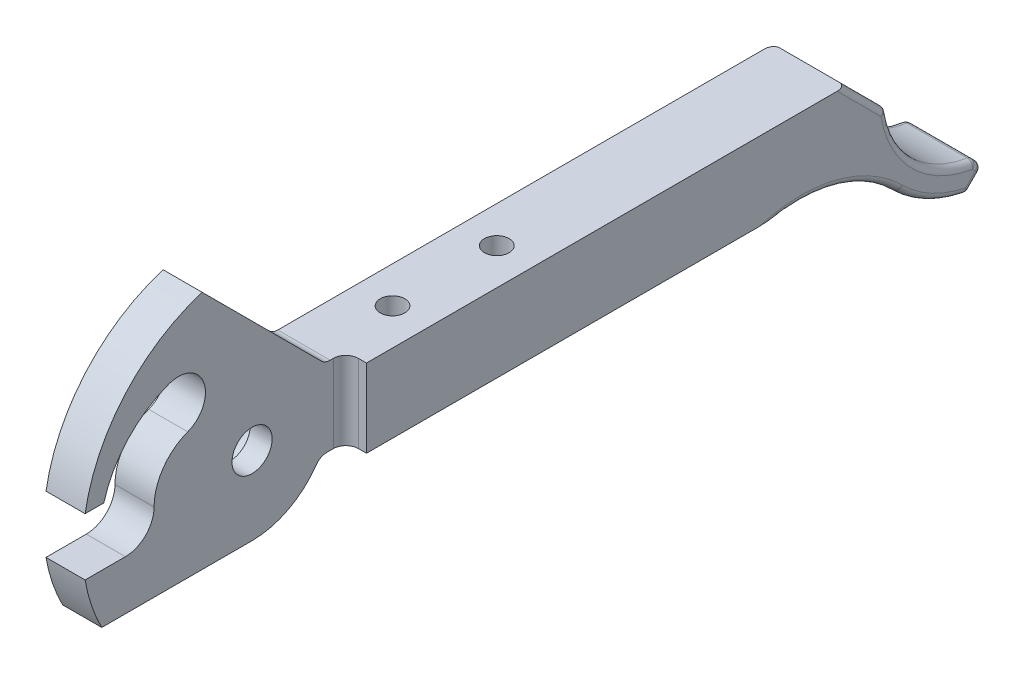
ISO-10303-21;
HEADER;
FILE_DESCRIPTION(('STEP AP214'),'2;1');
FILE_NAME('part.step','',(''),(''),'','','');
FILE_SCHEMA(('AUTOMOTIVE_DESIGN { 1 0 10303 214 1 1 1 1 }'));
ENDSEC;
DATA;
#1=APPLICATION_CONTEXT('core data for automotive mechanical design processes');
#2=APPLICATION_PROTOCOL_DEFINITION('international standard','automotive_design',2000,#1);
#3=PRODUCT_CONTEXT('',#1,'mechanical');
#4=PRODUCT('Part','Part','',(#3));
#5=PRODUCT_RELATED_PRODUCT_CATEGORY('part','',(#4));
#6=PRODUCT_DEFINITION_FORMATION('','',#4);
#7=PRODUCT_DEFINITION_CONTEXT('part definition',#1,'design');
#8=PRODUCT_DEFINITION('design','',#6,#7);
#9=PRODUCT_DEFINITION_SHAPE('','',#8);
#10=(LENGTH_UNIT() NAMED_UNIT(*) SI_UNIT(.MILLI.,.METRE.));
#11=(NAMED_UNIT(*) PLANE_ANGLE_UNIT() SI_UNIT($,.RADIAN.));
#12=(NAMED_UNIT(*) SI_UNIT($,.STERADIAN.) SOLID_ANGLE_UNIT());
#13=UNCERTAINTY_MEASURE_WITH_UNIT(LENGTH_MEASURE(1.E-05),#10,'distance_accuracy_value','');
#14=(GEOMETRIC_REPRESENTATION_CONTEXT(3) GLOBAL_UNCERTAINTY_ASSIGNED_CONTEXT((#13)) GLOBAL_UNIT_ASSIGNED_CONTEXT((#10,
#11,#12)) REPRESENTATION_CONTEXT('',''));
#15=CARTESIAN_POINT('',(0.,0.,0.));
#16=DIRECTION('',(0.,0.,1.));
#17=DIRECTION('',(1.,0.,0.));
#18=AXIS2_PLACEMENT_3D('',#15,#16,#17);
#19=CARTESIAN_POINT('',(-16.034004,-12.0851586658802,-85.6200279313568));
#20=DIRECTION('',(-1.,0.,0.));
#21=DIRECTION('',(0.,0.,1.));
#22=AXIS2_PLACEMENT_3D('',#19,#20,#21);
#23=CYLINDRICAL_SURFACE('',#22,0.762);
#24=DIRECTION('',(1.,0.,0.));
#25=VECTOR('',#24,1.);
#26=CARTESIAN_POINT('',(-4.445,-11.5463432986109,-86.1588432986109));
#27=LINE('',#26,#25);
#28=CARTESIAN_POINT('',(-3.683,-11.5463432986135,-86.1588432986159));
#29=VERTEX_POINT('',#28);
#30=CARTESIAN_POINT('',(3.683,-11.5463432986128,-86.1588432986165));
#31=VERTEX_POINT('',#30);
#32=EDGE_CURVE('E180',#29,#31,#27,.T.);
#33=ORIENTED_EDGE('',*,*,#32,.T.);
#34=CARTESIAN_POINT('',(3.683,-12.0851586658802,-85.6200279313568));
#35=DIRECTION('',(-1.,0.,0.));
#36=DIRECTION('',(0.,0.,1.));
#37=AXIS2_PLACEMENT_3D('',#34,#35,#36);
#38=CIRCLE('',#37,0.762);
#39=CARTESIAN_POINT('',(3.683,-12.0851586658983,-86.3820279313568));
#40=VERTEX_POINT('',#39);
#41=EDGE_CURVE('E175',#31,#40,#38,.T.);
#42=ORIENTED_EDGE('',*,*,#41,.T.);
#43=CARTESIAN_POINT('',(3.683,-12.0851586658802,-85.6200279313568));
#44=DIRECTION('',(-1.,0.,0.));
#45=DIRECTION('',(0.,0.,1.));
#46=AXIS2_PLACEMENT_3D('',#43,#44,#45);
#47=CIRCLE('',#46,0.762);
#48=CARTESIAN_POINT('',(3.683,-12.6239740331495,-86.1588432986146));
#49=VERTEX_POINT('',#48);
#50=EDGE_CURVE('E19',#40,#49,#47,.T.);
#51=ORIENTED_EDGE('',*,*,#50,.T.);
#52=DIRECTION('',(1.,0.,0.));
#53=VECTOR('',#52,1.);
#54=CARTESIAN_POINT('',(-4.445,-12.6239740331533,-86.1588432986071));
#55=LINE('',#54,#53);
#56=CARTESIAN_POINT('',(-3.68300000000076,-12.623974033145,-86.1588432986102));
#57=VERTEX_POINT('',#56);
#58=EDGE_CURVE('E472',#49,#57,#55,.F.);
#59=ORIENTED_EDGE('',*,*,#58,.T.);
#60=CARTESIAN_POINT('',(-3.683,-12.0851586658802,-85.6200279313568));
#61=DIRECTION('',(-1.,2.81391004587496E-12,0.));
#62=DIRECTION('',(0.,6.287384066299E-10,-1.));
#63=AXIS2_PLACEMENT_3D('',#60,#61,#62);
#64=CIRCLE('',#63,0.762);
#65=CARTESIAN_POINT('',(-3.683,-12.0851586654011,-86.3820279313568));
#66=VERTEX_POINT('',#65);
#67=EDGE_CURVE('E189',#66,#57,#64,.T.);
#68=ORIENTED_EDGE('',*,*,#67,.F.);
#69=CARTESIAN_POINT('',(-3.683,-12.0851586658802,-85.6200279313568));
#70=DIRECTION('',(-1.,0.,0.));
#71=DIRECTION('',(0.,0.,1.));
#72=AXIS2_PLACEMENT_3D('',#69,#70,#71);
#73=CIRCLE('',#72,0.762);
#74=EDGE_CURVE('E188',#29,#66,#73,.T.);
#75=ORIENTED_EDGE('',*,*,#74,.F.);
#76=EDGE_LOOP('',(#33,#42,#51,#59,#68,#75));
#77=FACE_BOUND('',#76,.T.);
#78=ADVANCED_FACE('F16',(#77),#23,.T.);
#79=CARTESIAN_POINT('',(-3.683,-12.0851586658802,-85.6200279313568));
#80=DIRECTION('',(0.,6.287384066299E-10,-1.));
#81=DIRECTION('',(1.,0.,0.));
#82=AXIS2_PLACEMENT_3D('',#79,#80,#81);
#83=SPHERICAL_SURFACE('',#82,0.762);
#84=ORIENTED_EDGE('',*,*,#74,.T.);
#85=ORIENTED_EDGE('',*,*,#67,.T.);
#86=CARTESIAN_POINT('',(-3.683,-12.0851586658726,-85.6200279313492));
#87=DIRECTION('',(0.,0.707106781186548,-0.707106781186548));
#88=DIRECTION('',(0.,0.707106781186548,0.707106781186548));
#89=AXIS2_PLACEMENT_3D('',#86,#87,#88);
#90=CIRCLE('',#89,0.762);
#91=CARTESIAN_POINT('',(-4.445,-12.0851586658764,-85.620027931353));
#92=VERTEX_POINT('',#91);
#93=EDGE_CURVE('E238',#92,#57,#90,.F.);
#94=ORIENTED_EDGE('',*,*,#93,.F.);
#95=CARTESIAN_POINT('',(-3.683,-12.0851586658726,-85.6200279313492));
#96=DIRECTION('',(0.,0.707106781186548,0.707106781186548));
#97=DIRECTION('',(0.,-0.707106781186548,0.707106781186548));
#98=AXIS2_PLACEMENT_3D('',#95,#96,#97);
#99=CIRCLE('',#98,0.762);
#100=EDGE_CURVE('E225',#29,#92,#99,.T.);
#101=ORIENTED_EDGE('',*,*,#100,.F.);
#102=EDGE_LOOP('',(#84,#85,#94,#101));
#103=FACE_BOUND('',#102,.T.);
#104=ADVANCED_FACE('F474',(#103),#83,.T.);
#105=CARTESIAN_POINT('',(-0.7366,0.,0.));
#106=DIRECTION('',(1.,0.,0.));
#107=DIRECTION('',(0.,0.,-1.));
#108=AXIS2_PLACEMENT_3D('',#105,#106,#107);
#109=PLANE('',#108);
#110=CARTESIAN_POINT('',(-0.7366,0.,0.));
#111=DIRECTION('',(-1.,0.,0.));
#112=DIRECTION('',(0.,0.,1.));
#113=AXIS2_PLACEMENT_3D('',#110,#111,#112);
#114=CIRCLE('',#113,2.44475);
#115=CARTESIAN_POINT('',(-0.7366,0.,2.44475));
#116=VERTEX_POINT('',#115);
#117=EDGE_CURVE('E217',#116,#116,#114,.F.);
#118=ORIENTED_EDGE('',*,*,#117,.T.);
#119=EDGE_LOOP('',(#118));
#120=FACE_BOUND('',#119,.T.);
#121=CARTESIAN_POINT('',(-0.7366,0.,0.));
#122=DIRECTION('',(1.,0.,0.));
#123=DIRECTION('',(0.,0.,-1.));
#124=AXIS2_PLACEMENT_3D('',#121,#122,#123);
#125=CIRCLE('',#124,4.445);
#126=CARTESIAN_POINT('',(-0.7366,0.,-4.445));
#127=VERTEX_POINT('',#126);
#128=EDGE_CURVE('E242',#127,#127,#125,.F.);
#129=ORIENTED_EDGE('',*,*,#128,.T.);
#130=EDGE_LOOP('',(#129));
#131=FACE_BOUND('',#130,.T.);
#132=ADVANCED_FACE('F477',(#120,#131),#109,.F.);
#133=CARTESIAN_POINT('',(2.921,0.,0.));
#134=DIRECTION('',(1.,0.,0.));
#135=DIRECTION('',(0.,0.,-1.));
#136=AXIS2_PLACEMENT_3D('',#133,#134,#135);
#137=PLANE('',#136);
#138=CARTESIAN_POINT('',(2.921,1.651,-67.056));
#139=DIRECTION('',(-1.,0.,0.));
#140=DIRECTION('',(0.,0.,1.));
#141=AXIS2_PLACEMENT_3D('',#138,#139,#140);
#142=CIRCLE('',#141,1.524);
#143=CARTESIAN_POINT('',(2.921,3.175,-67.056));
#144=VERTEX_POINT('',#143);
#145=CARTESIAN_POINT('',(2.921,1.651,-68.58));
#146=VERTEX_POINT('',#145);
#147=EDGE_CURVE('E254',#144,#146,#142,.T.);
#148=ORIENTED_EDGE('',*,*,#147,.T.);
#149=DIRECTION('',(0.,1.,0.));
#150=VECTOR('',#149,1.);
#151=CARTESIAN_POINT('',(2.921,-3.175,-68.58));
#152=LINE('',#151,#150);
#153=CARTESIAN_POINT('',(2.921,-1.651,-68.58));
#154=VERTEX_POINT('',#153);
#155=EDGE_CURVE('E258',#154,#146,#152,.T.);
#156=ORIENTED_EDGE('',*,*,#155,.F.);
#157=CARTESIAN_POINT('',(2.921,-1.651,-67.056));
#158=DIRECTION('',(-1.,0.,0.));
#159=DIRECTION('',(0.,0.,1.));
#160=AXIS2_PLACEMENT_3D('',#157,#158,#159);
#161=CIRCLE('',#160,1.524);
#162=CARTESIAN_POINT('',(2.921,-3.175,-67.056));
#163=VERTEX_POINT('',#162);
#164=EDGE_CURVE('E249',#154,#163,#161,.T.);
#165=ORIENTED_EDGE('',*,*,#164,.T.);
#166=DIRECTION('',(0.,0.,1.));
#167=VECTOR('',#166,1.);
#168=CARTESIAN_POINT('',(2.921,-3.175,-35.56));
#169=LINE('',#168,#167);
#170=CARTESIAN_POINT('',(2.921,-3.175,-37.084));
#171=VERTEX_POINT('',#170);
#172=EDGE_CURVE('E248',#171,#163,#169,.F.);
#173=ORIENTED_EDGE('',*,*,#172,.F.);
#174=CARTESIAN_POINT('',(2.921,-1.651,-37.084));
#175=DIRECTION('',(-1.,0.,0.));
#176=DIRECTION('',(0.,0.,1.));
#177=AXIS2_PLACEMENT_3D('',#174,#175,#176);
#178=CIRCLE('',#177,1.524);
#179=CARTESIAN_POINT('',(2.921,-1.651,-35.56));
#180=VERTEX_POINT('',#179);
#181=EDGE_CURVE('E245',#171,#180,#178,.T.);
#182=ORIENTED_EDGE('',*,*,#181,.T.);
#183=DIRECTION('',(0.,1.,0.));
#184=VECTOR('',#183,1.);
#185=CARTESIAN_POINT('',(2.921,3.175,-35.56));
#186=LINE('',#185,#184);
#187=CARTESIAN_POINT('',(2.921,1.651,-35.56));
#188=VERTEX_POINT('',#187);
#189=EDGE_CURVE('E560',#188,#180,#186,.F.);
#190=ORIENTED_EDGE('',*,*,#189,.F.);
#191=CARTESIAN_POINT('',(2.921,1.651,-37.084));
#192=DIRECTION('',(-1.,0.,0.));
#193=DIRECTION('',(0.,0.,1.));
#194=AXIS2_PLACEMENT_3D('',#191,#192,#193);
#195=CIRCLE('',#194,1.524);
#196=CARTESIAN_POINT('',(2.921,3.175,-37.084));
#197=VERTEX_POINT('',#196);
#198=EDGE_CURVE('E259',#188,#197,#195,.T.);
#199=ORIENTED_EDGE('',*,*,#198,.T.);
#200=DIRECTION('',(0.,0.,-1.));
#201=VECTOR('',#200,1.);
#202=CARTESIAN_POINT('',(2.921,3.175,-68.58));
#203=LINE('',#202,#201);
#204=EDGE_CURVE('E263',#144,#197,#203,.F.);
#205=ORIENTED_EDGE('',*,*,#204,.F.);
#206=EDGE_LOOP('',(#148,#156,#165,#173,#182,#190,#199,#205));
#207=FACE_BOUND('',#206,.T.);
#208=ADVANCED_FACE('F480',(#207),#137,.F.);
#209=CARTESIAN_POINT('',(-2.82575,0.,0.));
#210=DIRECTION('',(-1.,0.,0.));
#211=DIRECTION('',(0.,0.,1.));
#212=AXIS2_PLACEMENT_3D('',#209,#210,#211);
#213=PLANE('',#212);
#214=DIRECTION('',(0.,0.,-1.));
#215=VECTOR('',#214,1.);
#216=CARTESIAN_POINT('',(-2.82575,-9.525,18.3079431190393));
#217=LINE('',#216,#215);
#218=CARTESIAN_POINT('',(-2.82575,-9.525,18.3079431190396));
#219=VERTEX_POINT('',#218);
#220=CARTESIAN_POINT('',(-2.82575,-9.525,5.588));
#221=VERTEX_POINT('',#220);
#222=EDGE_CURVE('E456',#219,#221,#217,.T.);
#223=ORIENTED_EDGE('',*,*,#222,.F.);
#224=CARTESIAN_POINT('',(-2.82575,0.,0.));
#225=DIRECTION('',(-1.,0.,0.));
#226=DIRECTION('',(0.,0.,1.));
#227=AXIS2_PLACEMENT_3D('',#224,#225,#226);
#228=CIRCLE('',#227,20.6375);
#229=CARTESIAN_POINT('',(-2.82575,-3.4925,20.339834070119));
#230=VERTEX_POINT('',#229);
#231=EDGE_CURVE('E193',#230,#219,#228,.F.);
#232=ORIENTED_EDGE('',*,*,#231,.F.);
#233=DIRECTION('',(0.,0.,1.));
#234=VECTOR('',#233,1.);
#235=CARTESIAN_POINT('',(-2.82575,-3.4925,15.4305));
#236=LINE('',#235,#234);
#237=CARTESIAN_POINT('',(-2.82575,-3.4925,15.4305));
#238=VERTEX_POINT('',#237);
#239=EDGE_CURVE('E197',#238,#230,#236,.T.);
#240=ORIENTED_EDGE('',*,*,#239,.F.);
#241=CARTESIAN_POINT('',(-2.82575,0.,15.4305));
#242=DIRECTION('',(-1.,0.,0.));
#243=DIRECTION('',(0.,0.,1.));
#244=AXIS2_PLACEMENT_3D('',#241,#242,#243);
#245=CIRCLE('',#244,3.4925);
#246=CARTESIAN_POINT('',(-2.82575,0.,11.938));
#247=VERTEX_POINT('',#246);
#248=EDGE_CURVE('E198',#238,#247,#245,.F.);
#249=ORIENTED_EDGE('',*,*,#248,.T.);
#250=CARTESIAN_POINT('',(-2.82575,0.,5.66857058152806));
#251=DIRECTION('',(-1.,0.,0.));
#252=DIRECTION('',(0.,0.,1.));
#253=AXIS2_PLACEMENT_3D('',#250,#251,#252);
#254=CIRCLE('',#253,6.26942941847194);
#255=CARTESIAN_POINT('',(-2.82575,5.88220206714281,7.83777413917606));
#256=VERTEX_POINT('',#255);
#257=EDGE_CURVE('E201',#256,#247,#254,.F.);
#258=ORIENTED_EDGE('',*,*,#257,.F.);
#259=CARTESIAN_POINT('',(-2.82575,8.98025612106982,8.98025612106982));
#260=DIRECTION('',(-1.,0.,0.));
#261=DIRECTION('',(0.,0.,1.));
#262=AXIS2_PLACEMENT_3D('',#259,#260,#261);
#263=CIRCLE('',#262,3.302);
#264=CARTESIAN_POINT('',(-2.82575,12.0783101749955,10.1227381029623));
#265=VERTEX_POINT('',#264);
#266=EDGE_CURVE('E205',#256,#265,#263,.F.);
#267=ORIENTED_EDGE('',*,*,#266,.T.);
#268=CARTESIAN_POINT('',(-2.82575,0.,5.66857058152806));
#269=DIRECTION('',(-1.,0.,0.));
#270=DIRECTION('',(0.,0.,1.));
#271=AXIS2_PLACEMENT_3D('',#268,#269,#270);
#272=CIRCLE('',#271,12.8734294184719);
#273=CARTESIAN_POINT('',(-2.82575,3.4925,18.0591972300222));
#274=VERTEX_POINT('',#273);
#275=EDGE_CURVE('E209',#265,#274,#272,.F.);
#276=ORIENTED_EDGE('',*,*,#275,.T.);
#277=DIRECTION('',(0.,0.,-1.));
#278=VECTOR('',#277,1.);
#279=CARTESIAN_POINT('',(-2.82575,3.4925,25.4));
#280=LINE('',#279,#278);
#281=CARTESIAN_POINT('',(-2.82575,3.4925000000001,20.3398340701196));
#282=VERTEX_POINT('',#281);
#283=EDGE_CURVE('E212',#282,#274,#280,.T.);
#284=ORIENTED_EDGE('',*,*,#283,.F.);
#285=CARTESIAN_POINT('',(-2.82575,0.,0.));
#286=DIRECTION('',(-1.,0.,0.));
#287=DIRECTION('',(0.,0.,1.));
#288=AXIS2_PLACEMENT_3D('',#285,#286,#287);
#289=CIRCLE('',#288,20.6375);
#290=CARTESIAN_POINT('',(-2.82575,19.7235469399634,6.0735576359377));
#291=VERTEX_POINT('',#290);
#292=EDGE_CURVE('E213',#291,#282,#289,.F.);
#293=ORIENTED_EDGE('',*,*,#292,.F.);
#294=DIRECTION('',(0.,0.707106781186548,0.707106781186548));
#295=VECTOR('',#294,1.);
#296=CARTESIAN_POINT('',(-2.82575,4.7625,-8.88748930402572));
#297=LINE('',#296,#295);
#298=CARTESIAN_POINT('',(-2.82575,10.7763073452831,-2.87368195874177));
#299=VERTEX_POINT('',#298);
#300=EDGE_CURVE('E539',#299,#291,#297,.T.);
#301=ORIENTED_EDGE('',*,*,#300,.F.);
#302=DIRECTION('',(0.,-0.707106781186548,0.707106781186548));
#303=VECTOR('',#302,1.);
#304=CARTESIAN_POINT('',(-2.82575,10.7763073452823,-2.87368195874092));
#305=LINE('',#304,#303);
#306=CARTESIAN_POINT('',(-2.82575,3.95131269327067,3.95131269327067));
#307=VERTEX_POINT('',#306);
#308=EDGE_CURVE('E228',#307,#299,#305,.F.);
#309=ORIENTED_EDGE('',*,*,#308,.F.);
#310=CARTESIAN_POINT('',(-2.82575,0.,0.));
#311=DIRECTION('',(-1.,0.,0.));
#312=DIRECTION('',(0.,0.,1.));
#313=AXIS2_PLACEMENT_3D('',#310,#311,#312);
#314=CIRCLE('',#313,5.588);
#315=CARTESIAN_POINT('',(-2.82575,0.,5.588));
#316=VERTEX_POINT('',#315);
#317=EDGE_CURVE('E221',#316,#307,#314,.T.);
#318=ORIENTED_EDGE('',*,*,#317,.F.);
#319=DIRECTION('',(0.,1.,0.));
#320=VECTOR('',#319,1.);
#321=CARTESIAN_POINT('',(-2.82575,0.,5.588));
#322=LINE('',#321,#320);
#323=EDGE_CURVE('E463',#221,#316,#322,.T.);
#324=ORIENTED_EDGE('',*,*,#323,.F.);
#325=EDGE_LOOP('',(#223,#232,#240,#249,#258,#267,#276,#284,#293,#301,#309,#318,#324));
#326=FACE_BOUND('',#325,.T.);
#327=ADVANCED_FACE('F484',(#326),#213,.T.);
#328=CARTESIAN_POINT('',(-4.445,0.,0.));
#329=DIRECTION('',(-1.,0.,0.));
#330=DIRECTION('',(0.,0.,1.));
#331=AXIS2_PLACEMENT_3D('',#328,#329,#330);
#332=CYLINDRICAL_SURFACE('',#331,20.6375);
#333=DIRECTION('',(1.,0.,0.));
#334=VECTOR('',#333,1.);
#335=CARTESIAN_POINT('',(-11.89228,-9.525,18.3079431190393));
#336=LINE('',#335,#334);
#337=CARTESIAN_POINT('',(1.93675,-9.525,18.3079431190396));
#338=VERTEX_POINT('',#337);
#339=EDGE_CURVE('E460',#338,#219,#336,.F.);
#340=ORIENTED_EDGE('',*,*,#339,.F.);
#341=CARTESIAN_POINT('',(1.93675,0.,0.));
#342=DIRECTION('',(-1.,0.,0.));
#343=DIRECTION('',(0.,0.,1.));
#344=AXIS2_PLACEMENT_3D('',#341,#342,#343);
#345=CIRCLE('',#344,20.6375);
#346=CARTESIAN_POINT('',(1.93675,-3.4925,20.339834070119));
#347=VERTEX_POINT('',#346);
#348=EDGE_CURVE('E269',#338,#347,#345,.T.);
#349=ORIENTED_EDGE('',*,*,#348,.T.);
#350=DIRECTION('',(1.,0.,0.));
#351=VECTOR('',#350,1.);
#352=CARTESIAN_POINT('',(5.334,-3.4925,20.3398340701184));
#353=LINE('',#352,#351);
#354=EDGE_CURVE('E452',#230,#347,#353,.T.);
#355=ORIENTED_EDGE('',*,*,#354,.F.);
#356=ORIENTED_EDGE('',*,*,#231,.T.);
#357=EDGE_LOOP('',(#340,#349,#355,#356));
#358=FACE_BOUND('',#357,.T.);
#359=ADVANCED_FACE('F488',(#358),#332,.T.);
#360=CARTESIAN_POINT('',(5.334,-3.4925,15.4305));
#361=DIRECTION('',(0.,1.,0.));
#362=DIRECTION('',(0.,0.,1.));
#363=AXIS2_PLACEMENT_3D('',#360,#361,#362);
#364=PLANE('',#363);
#365=ORIENTED_EDGE('',*,*,#354,.T.);
#366=DIRECTION('',(0.,0.,1.));
#367=VECTOR('',#366,1.);
#368=CARTESIAN_POINT('',(1.93675,-3.4925,0.));
#369=LINE('',#368,#367);
#370=CARTESIAN_POINT('',(1.93675,-3.4925,15.4305));
#371=VERTEX_POINT('',#370);
#372=EDGE_CURVE('E272',#347,#371,#369,.F.);
#373=ORIENTED_EDGE('',*,*,#372,.T.);
#374=DIRECTION('',(-1.,0.,0.));
#375=VECTOR('',#374,1.);
#376=CARTESIAN_POINT('',(5.334,-3.4925,15.4305));
#377=LINE('',#376,#375);
#378=EDGE_CURVE('E202',#371,#238,#377,.T.);
#379=ORIENTED_EDGE('',*,*,#378,.T.);
#380=ORIENTED_EDGE('',*,*,#239,.T.);
#381=EDGE_LOOP('',(#365,#373,#379,#380));
#382=FACE_BOUND('',#381,.T.);
#383=ADVANCED_FACE('F492',(#382),#364,.T.);
#384=CARTESIAN_POINT('',(5.334,0.,15.4305));
#385=DIRECTION('',(-1.,0.,0.));
#386=DIRECTION('',(0.,0.,1.));
#387=AXIS2_PLACEMENT_3D('',#384,#385,#386);
#388=CYLINDRICAL_SURFACE('',#387,3.4925);
#389=ORIENTED_EDGE('',*,*,#248,.F.);
#390=ORIENTED_EDGE('',*,*,#378,.F.);
#391=CARTESIAN_POINT('',(1.93675,0.,15.4305));
#392=DIRECTION('',(-1.,0.,0.));
#393=DIRECTION('',(0.,0.,1.));
#394=AXIS2_PLACEMENT_3D('',#391,#392,#393);
#395=CIRCLE('',#394,3.4925);
#396=CARTESIAN_POINT('',(1.93675,0.,11.938));
#397=VERTEX_POINT('',#396);
#398=EDGE_CURVE('E273',#371,#397,#395,.F.);
#399=ORIENTED_EDGE('',*,*,#398,.T.);
#400=DIRECTION('',(-1.,0.,0.));
#401=VECTOR('',#400,1.);
#402=CARTESIAN_POINT('',(5.334,0.,11.938));
#403=LINE('',#402,#401);
#404=EDGE_CURVE('E204',#247,#397,#403,.F.);
#405=ORIENTED_EDGE('',*,*,#404,.F.);
#406=EDGE_LOOP('',(#389,#390,#399,#405));
#407=FACE_BOUND('',#406,.T.);
#408=ADVANCED_FACE('F496',(#407),#388,.F.);
#409=CARTESIAN_POINT('',(5.334,0.,5.66857058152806));
#410=DIRECTION('',(-1.,0.,0.));
#411=DIRECTION('',(0.,0.,1.));
#412=AXIS2_PLACEMENT_3D('',#409,#410,#411);
#413=CYLINDRICAL_SURFACE('',#412,6.26942941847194);
#414=ORIENTED_EDGE('',*,*,#404,.T.);
#415=CARTESIAN_POINT('',(1.93675,0.,5.66857058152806));
#416=DIRECTION('',(-1.,0.,0.));
#417=DIRECTION('',(0.,0.,1.));
#418=AXIS2_PLACEMENT_3D('',#415,#416,#417);
#419=CIRCLE('',#418,6.26942941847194);
#420=CARTESIAN_POINT('',(1.93675,5.88220206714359,7.83777413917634));
#421=VERTEX_POINT('',#420);
#422=EDGE_CURVE('E276',#397,#421,#419,.T.);
#423=ORIENTED_EDGE('',*,*,#422,.T.);
#424=DIRECTION('',(-1.,0.,0.));
#425=VECTOR('',#424,1.);
#426=CARTESIAN_POINT('',(5.334,5.88220206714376,7.83777413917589));
#427=LINE('',#426,#425);
#428=EDGE_CURVE('E208',#421,#256,#427,.T.);
#429=ORIENTED_EDGE('',*,*,#428,.T.);
#430=ORIENTED_EDGE('',*,*,#257,.T.);
#431=EDGE_LOOP('',(#414,#423,#429,#430));
#432=FACE_BOUND('',#431,.T.);
#433=ADVANCED_FACE('F500',(#432),#413,.T.);
#434=CARTESIAN_POINT('',(5.334,8.98025612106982,8.98025612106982));
#435=DIRECTION('',(-1.,0.,0.));
#436=DIRECTION('',(0.,0.,1.));
#437=AXIS2_PLACEMENT_3D('',#434,#435,#436);
#438=CYLINDRICAL_SURFACE('',#437,3.302);
#439=ORIENTED_EDGE('',*,*,#266,.F.);
#440=ORIENTED_EDGE('',*,*,#428,.F.);
#441=CARTESIAN_POINT('',(1.93675,8.98025612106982,8.98025612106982));
#442=DIRECTION('',(-1.,0.,0.));
#443=DIRECTION('',(0.,0.,1.));
#444=AXIS2_PLACEMENT_3D('',#441,#442,#443);
#445=CIRCLE('',#444,3.302);
#446=CARTESIAN_POINT('',(1.93675,12.0783101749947,10.122738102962));
#447=VERTEX_POINT('',#446);
#448=EDGE_CURVE('E279',#421,#447,#445,.F.);
#449=ORIENTED_EDGE('',*,*,#448,.T.);
#450=DIRECTION('',(-1.,0.,0.));
#451=VECTOR('',#450,1.);
#452=CARTESIAN_POINT('',(5.334,12.0783101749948,10.1227381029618));
#453=LINE('',#452,#451);
#454=EDGE_CURVE('E207',#447,#265,#453,.T.);
#455=ORIENTED_EDGE('',*,*,#454,.T.);
#456=EDGE_LOOP('',(#439,#440,#449,#455));
#457=FACE_BOUND('',#456,.T.);
#458=ADVANCED_FACE('F504',(#457),#438,.F.);
#459=CARTESIAN_POINT('',(5.334,0.,5.66857058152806));
#460=DIRECTION('',(-1.,0.,0.));
#461=DIRECTION('',(0.,0.,1.));
#462=AXIS2_PLACEMENT_3D('',#459,#460,#461);
#463=CYLINDRICAL_SURFACE('',#462,12.8734294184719);
#464=ORIENTED_EDGE('',*,*,#275,.F.);
#465=ORIENTED_EDGE('',*,*,#454,.F.);
#466=CARTESIAN_POINT('',(1.93675,0.,5.66857058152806));
#467=DIRECTION('',(-1.,0.,0.));
#468=DIRECTION('',(0.,0.,1.));
#469=AXIS2_PLACEMENT_3D('',#466,#467,#468);
#470=CIRCLE('',#469,12.8734294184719);
#471=CARTESIAN_POINT('',(1.93675,3.4925,18.0591972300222));
#472=VERTEX_POINT('',#471);
#473=EDGE_CURVE('E282',#447,#472,#470,.F.);
#474=ORIENTED_EDGE('',*,*,#473,.T.);
#475=DIRECTION('',(1.,0.,0.));
#476=VECTOR('',#475,1.);
#477=CARTESIAN_POINT('',(5.334,3.4925,18.059197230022));
#478=LINE('',#477,#476);
#479=EDGE_CURVE('E216',#274,#472,#478,.T.);
#480=ORIENTED_EDGE('',*,*,#479,.F.);
#481=EDGE_LOOP('',(#464,#465,#474,#480));
#482=FACE_BOUND('',#481,.T.);
#483=ADVANCED_FACE('F508',(#482),#463,.F.);
#484=CARTESIAN_POINT('',(5.334,3.4925,25.4));
#485=DIRECTION('',(0.,-1.,0.));
#486=DIRECTION('',(0.,0.,-1.));
#487=AXIS2_PLACEMENT_3D('',#484,#485,#486);
#488=PLANE('',#487);
#489=ORIENTED_EDGE('',*,*,#479,.T.);
#490=DIRECTION('',(0.,0.,1.));
#491=VECTOR('',#490,1.);
#492=CARTESIAN_POINT('',(1.93675,3.4925,0.));
#493=LINE('',#492,#491);
#494=CARTESIAN_POINT('',(1.93675,3.4925000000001,20.3398340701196));
#495=VERTEX_POINT('',#494);
#496=EDGE_CURVE('E285',#472,#495,#493,.T.);
#497=ORIENTED_EDGE('',*,*,#496,.T.);
#498=DIRECTION('',(-1.,0.,0.));
#499=VECTOR('',#498,1.);
#500=CARTESIAN_POINT('',(-4.445,3.4925000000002,20.3398340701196));
#501=LINE('',#500,#499);
#502=EDGE_CURVE('E215',#282,#495,#501,.F.);
#503=ORIENTED_EDGE('',*,*,#502,.F.);
#504=ORIENTED_EDGE('',*,*,#283,.T.);
#505=EDGE_LOOP('',(#489,#497,#503,#504));
#506=FACE_BOUND('',#505,.T.);
#507=ADVANCED_FACE('F512',(#506),#488,.T.);
#508=CARTESIAN_POINT('',(-4.445,0.,0.));
#509=DIRECTION('',(-1.,0.,0.));
#510=DIRECTION('',(0.,0.,1.));
#511=AXIS2_PLACEMENT_3D('',#508,#509,#510);
#512=CYLINDRICAL_SURFACE('',#511,20.6375);
#513=ORIENTED_EDGE('',*,*,#502,.T.);
#514=CARTESIAN_POINT('',(1.93675,0.,0.));
#515=DIRECTION('',(-1.,0.,0.));
#516=DIRECTION('',(0.,0.,1.));
#517=AXIS2_PLACEMENT_3D('',#514,#515,#516);
#518=CIRCLE('',#517,20.6375);
#519=CARTESIAN_POINT('',(1.93675,19.7235469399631,6.07355763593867));
#520=VERTEX_POINT('',#519);
#521=EDGE_CURVE('E286',#495,#520,#518,.T.);
#522=ORIENTED_EDGE('',*,*,#521,.T.);
#523=DIRECTION('',(1.,0.,0.));
#524=VECTOR('',#523,1.);
#525=CARTESIAN_POINT('',(-11.89228,19.7235469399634,6.07355763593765));
#526=LINE('',#525,#524);
#527=EDGE_CURVE('E536',#291,#520,#526,.T.);
#528=ORIENTED_EDGE('',*,*,#527,.F.);
#529=ORIENTED_EDGE('',*,*,#292,.T.);
#530=EDGE_LOOP('',(#513,#522,#528,#529));
#531=FACE_BOUND('',#530,.T.);
#532=ADVANCED_FACE('F516',(#531),#512,.T.);
#533=CARTESIAN_POINT('',(1.93675,0.,0.));
#534=DIRECTION('',(-1.,0.,0.));
#535=DIRECTION('',(0.,0.,1.));
#536=AXIS2_PLACEMENT_3D('',#533,#534,#535);
#537=CYLINDRICAL_SURFACE('',#536,2.44475);
#538=CARTESIAN_POINT('',(1.93675,0.,0.));
#539=DIRECTION('',(-1.,0.,0.));
#540=DIRECTION('',(0.,0.,1.));
#541=AXIS2_PLACEMENT_3D('',#538,#539,#540);
#542=CIRCLE('',#541,2.44475);
#543=CARTESIAN_POINT('',(1.93675,0.,2.44475));
#544=VERTEX_POINT('',#543);
#545=EDGE_CURVE('E290',#544,#544,#542,.F.);
#546=ORIENTED_EDGE('',*,*,#545,.T.);
#547=EDGE_LOOP('',(#546));
#548=FACE_BOUND('',#547,.T.);
#549=ORIENTED_EDGE('',*,*,#117,.F.);
#550=EDGE_LOOP('',(#549));
#551=FACE_BOUND('',#550,.T.);
#552=ADVANCED_FACE('F520',(#548,#551),#537,.F.);
#553=CARTESIAN_POINT('',(-3.683,-0.593328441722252,-74.1281977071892));
#554=DIRECTION('',(0.,0.4557404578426,-0.8901127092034));
#555=DIRECTION('',(1.,0.,0.));
#556=AXIS2_PLACEMENT_3D('',#553,#554,#555);
#557=SPHERICAL_SURFACE('',#556,0.762);
#558=CARTESIAN_POINT('',(-3.683,-0.593328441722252,-74.1281977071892));
#559=DIRECTION('',(-1.,0.,0.));
#560=DIRECTION('',(0.,0.,1.));
#561=AXIS2_PLACEMENT_3D('',#558,#559,#560);
#562=CIRCLE('',#561,0.762);
#563=CARTESIAN_POINT('',(-3.683,-0.24605421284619,-74.8064635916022));
#564=VERTEX_POINT('',#563);
#565=CARTESIAN_POINT('',(-3.683,-0.0545130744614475,-74.6670130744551));
#566=VERTEX_POINT('',#565);
#567=EDGE_CURVE('E300',#564,#566,#562,.F.);
#568=ORIENTED_EDGE('',*,*,#567,.F.);
#569=CARTESIAN_POINT('',(-3.683,-0.593328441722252,-74.1281977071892));
#570=DIRECTION('',(-1.,0.,0.));
#571=DIRECTION('',(0.,0.,1.));
#572=AXIS2_PLACEMENT_3D('',#569,#570,#571);
#573=CIRCLE('',#572,0.762);
#574=CARTESIAN_POINT('',(-3.683,-0.47116849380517,-74.8803419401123));
#575=VERTEX_POINT('',#574);
#576=EDGE_CURVE('E33',#575,#564,#573,.F.);
#577=ORIENTED_EDGE('',*,*,#576,.F.);
#578=CARTESIAN_POINT('',(-3.683,-0.593328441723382,-74.1281977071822));
#579=DIRECTION('',(0.,-0.98706592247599,-0.160314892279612));
#580=DIRECTION('',(0.,-0.160314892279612,0.98706592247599));
#581=AXIS2_PLACEMENT_3D('',#578,#579,#580);
#582=CIRCLE('',#581,0.762);
#583=CARTESIAN_POINT('',(-4.445,-0.593328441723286,-74.1281977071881));
#584=VERTEX_POINT('',#583);
#585=EDGE_CURVE('E311',#584,#575,#582,.T.);
#586=ORIENTED_EDGE('',*,*,#585,.F.);
#587=CARTESIAN_POINT('',(-3.683,-0.593328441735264,-74.1281977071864));
#588=DIRECTION('',(0.,0.707106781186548,0.707106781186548));
#589=DIRECTION('',(0.,-0.707106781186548,0.707106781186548));
#590=AXIS2_PLACEMENT_3D('',#587,#588,#589);
#591=CIRCLE('',#590,0.762);
#592=EDGE_CURVE('E293',#566,#584,#591,.T.);
#593=ORIENTED_EDGE('',*,*,#592,.F.);
#594=EDGE_LOOP('',(#568,#577,#586,#593));
#595=FACE_BOUND('',#594,.T.);
#596=ADVANCED_FACE('F524',(#595),#557,.T.);
#597=CARTESIAN_POINT('',(-4.445,-12.0851586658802,-86.6976586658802));
#598=DIRECTION('',(0.,-0.707106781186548,0.707106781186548));
#599=DIRECTION('',(0.,-0.707106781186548,-0.707106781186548));
#600=AXIS2_PLACEMENT_3D('',#597,#598,#599);
#601=PLANE('',#600);
#602=DIRECTION('',(0.,0.707106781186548,0.707106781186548));
#603=VECTOR('',#602,1.);
#604=CARTESIAN_POINT('',(-3.683,4.89527488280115,-69.7172251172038));
#605=LINE('',#604,#603);
#606=CARTESIAN_POINT('',(-3.683,-11.1842354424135,-85.796735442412));
#607=VERTEX_POINT('',#606);
#608=EDGE_CURVE('E232',#607,#29,#605,.F.);
#609=ORIENTED_EDGE('',*,*,#608,.F.);
#610=DIRECTION('',(1.,0.,0.));
#611=VECTOR('',#610,1.);
#612=CARTESIAN_POINT('',(16.034004,-11.1842354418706,-85.7967354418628));
#613=LINE('',#612,#611);
#614=CARTESIAN_POINT('',(3.683,-11.1842354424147,-85.7967354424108));
#615=VERTEX_POINT('',#614);
#616=EDGE_CURVE('E316',#615,#607,#613,.F.);
#617=ORIENTED_EDGE('',*,*,#616,.F.);
#618=DIRECTION('',(0.,-0.707106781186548,-0.707106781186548));
#619=VECTOR('',#618,1.);
#620=CARTESIAN_POINT('',(3.683,-12.0851586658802,-86.6976586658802));
#621=LINE('',#620,#619);
#622=EDGE_CURVE('E220',#31,#615,#621,.F.);
#623=ORIENTED_EDGE('',*,*,#622,.F.);
#624=ORIENTED_EDGE('',*,*,#32,.F.);
#625=EDGE_LOOP('',(#609,#617,#623,#624));
#626=FACE_BOUND('',#625,.T.);
#627=ADVANCED_FACE('F529',(#626),#601,.F.);
#628=CARTESIAN_POINT('',(-3.683,-11.7230508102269,-85.2579200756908));
#629=DIRECTION('',(0.,0.890112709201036,-0.455740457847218));
#630=DIRECTION('',(1.,0.,0.));
#631=AXIS2_PLACEMENT_3D('',#628,#629,#630);
#632=SPHERICAL_SURFACE('',#631,0.762);
#633=CARTESIAN_POINT('',(-3.683,-11.7230508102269,-85.2579200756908));
#634=DIRECTION('',(1.,0.,0.));
#635=DIRECTION('',(0.,0.,-1.));
#636=AXIS2_PLACEMENT_3D('',#633,#634,#635);
#637=CIRCLE('',#636,0.762);
#638=CARTESIAN_POINT('',(-3.683,-11.0447849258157,-85.6051943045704));
#639=VERTEX_POINT('',#638);
#640=CARTESIAN_POINT('',(-3.683,-10.9709065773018,-85.3800800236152));
#641=VERTEX_POINT('',#640);
#642=EDGE_CURVE('E317',#639,#641,#637,.T.);
#643=ORIENTED_EDGE('',*,*,#642,.F.);
#644=CARTESIAN_POINT('',(-3.683,-11.7230508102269,-85.2579200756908));
#645=DIRECTION('',(1.,0.,0.));
#646=DIRECTION('',(0.,0.,-1.));
#647=AXIS2_PLACEMENT_3D('',#644,#645,#646);
#648=CIRCLE('',#647,0.762);
#649=EDGE_CURVE('E321',#607,#639,#648,.T.);
#650=ORIENTED_EDGE('',*,*,#649,.F.);
#651=CARTESIAN_POINT('',(-3.683,-11.7230508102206,-85.2579200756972));
#652=DIRECTION('',(0.,0.707106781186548,0.707106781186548));
#653=DIRECTION('',(0.,-0.707106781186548,0.707106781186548));
#654=AXIS2_PLACEMENT_3D('',#651,#652,#653);
#655=CIRCLE('',#654,0.762);
#656=CARTESIAN_POINT('',(-4.445,-11.7230508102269,-85.2579200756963));
#657=VERTEX_POINT('',#656);
#658=EDGE_CURVE('E227',#657,#607,#655,.F.);
#659=ORIENTED_EDGE('',*,*,#658,.F.);
#660=CARTESIAN_POINT('',(-3.683,-11.7230508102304,-85.2579200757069));
#661=DIRECTION('',(0.,-0.160314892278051,-0.987065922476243));
#662=DIRECTION('',(0.,-0.987065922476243,0.160314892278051));
#663=AXIS2_PLACEMENT_3D('',#660,#661,#662);
#664=CIRCLE('',#663,0.762);
#665=EDGE_CURVE('E306',#641,#657,#664,.F.);
#666=ORIENTED_EDGE('',*,*,#665,.F.);
#667=EDGE_LOOP('',(#643,#650,#659,#666));
#668=FACE_BOUND('',#667,.T.);
#669=ADVANCED_FACE('F687',(#668),#632,.T.);
#670=CARTESIAN_POINT('',(-3.683,-13.2544059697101,-84.4507806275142));
#671=DIRECTION('',(0.,-0.95710566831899,-0.289739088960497));
#672=DIRECTION('',(1.,0.,0.));
#673=AXIS2_PLACEMENT_3D('',#670,#671,#672);
#674=SPHERICAL_SURFACE('',#673,0.762);
#675=CARTESIAN_POINT('',(-3.683,-13.2544059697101,-84.4507806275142));
#676=DIRECTION('',(-1.,0.,0.));
#677=DIRECTION('',(0.,0.,1.));
#678=AXIS2_PLACEMENT_3D('',#675,#676,#677);
#679=CIRCLE('',#678,0.762);
#680=CARTESIAN_POINT('',(-3.683,-13.9837204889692,-84.6715618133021));
#681=VERTEX_POINT('',#680);
#682=CARTESIAN_POINT('',(-3.683,-13.7932213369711,-84.9895959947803));
#683=VERTEX_POINT('',#682);
#684=EDGE_CURVE('E331',#681,#683,#679,.F.);
#685=ORIENTED_EDGE('',*,*,#684,.F.);
#686=CARTESIAN_POINT('',(-3.683,-13.2544059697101,-84.4507806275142));
#687=DIRECTION('',(-1.,0.,0.));
#688=DIRECTION('',(0.,0.,1.));
#689=AXIS2_PLACEMENT_3D('',#686,#687,#688);
#690=CIRCLE('',#689,0.762);
#691=CARTESIAN_POINT('',(-3.683,-14.0015943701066,-84.3012697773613));
#692=VERTEX_POINT('',#691);
#693=EDGE_CURVE('E330',#692,#681,#690,.F.);
#694=ORIENTED_EDGE('',*,*,#693,.F.);
#695=CARTESIAN_POINT('',(-3.683,-13.2544059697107,-84.450780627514));
#696=DIRECTION('',(0.,-0.196208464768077,-0.980562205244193));
#697=DIRECTION('',(0.,-0.980562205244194,0.196208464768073));
#698=AXIS2_PLACEMENT_3D('',#695,#696,#697);
#699=CIRCLE('',#698,0.762);
#700=CARTESIAN_POINT('',(-4.445,-13.2544059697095,-84.4507806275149));
#701=VERTEX_POINT('',#700);
#702=EDGE_CURVE('E325',#701,#692,#699,.F.);
#703=ORIENTED_EDGE('',*,*,#702,.F.);
#704=CARTESIAN_POINT('',(-3.683,-13.2544059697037,-84.450780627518));
#705=DIRECTION('',(0.,0.707106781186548,-0.707106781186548));
#706=DIRECTION('',(0.,0.707106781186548,0.707106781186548));
#707=AXIS2_PLACEMENT_3D('',#704,#705,#706);
#708=CIRCLE('',#707,0.762);
#709=EDGE_CURVE('E235',#683,#701,#708,.T.);
#710=ORIENTED_EDGE('',*,*,#709,.F.);
#711=EDGE_LOOP('',(#685,#694,#703,#710));
#712=FACE_BOUND('',#711,.T.);
#713=ADVANCED_FACE('F591',(#712),#674,.T.);
#714=CARTESIAN_POINT('',(-4.445,-16.8476586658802,-81.9351586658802));
#715=DIRECTION('',(0.,0.707106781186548,0.707106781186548));
#716=DIRECTION('',(0.,-0.707106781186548,0.707106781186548));
#717=AXIS2_PLACEMENT_3D('',#714,#715,#716);
#718=PLANE('',#717);
#719=DIRECTION('',(0.,0.707106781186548,-0.707106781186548));
#720=VECTOR('',#719,1.);
#721=CARTESIAN_POINT('',(-3.683,-12.4911991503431,-86.2916181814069));
#722=LINE('',#721,#720);
#723=EDGE_CURVE('E241',#57,#683,#722,.F.);
#724=ORIENTED_EDGE('',*,*,#723,.F.);
#725=ORIENTED_EDGE('',*,*,#58,.F.);
#726=DIRECTION('',(0.,-0.707106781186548,0.707106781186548));
#727=VECTOR('',#726,1.);
#728=CARTESIAN_POINT('',(3.683,-16.8476586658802,-81.9351586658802));
#729=LINE('',#728,#727);
#730=CARTESIAN_POINT('',(3.683,-13.7932213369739,-84.9895959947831));
#731=VERTEX_POINT('',#730);
#732=EDGE_CURVE('E467',#731,#49,#729,.F.);
#733=ORIENTED_EDGE('',*,*,#732,.F.);
#734=DIRECTION('',(-1.,0.,0.));
#735=VECTOR('',#734,1.);
#736=CARTESIAN_POINT('',(-16.034004,-13.7932213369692,-84.9895959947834));
#737=LINE('',#736,#735);
#738=EDGE_CURVE('E334',#683,#731,#737,.F.);
#739=ORIENTED_EDGE('',*,*,#738,.F.);
#740=EDGE_LOOP('',(#724,#725,#733,#739));
#741=FACE_BOUND('',#740,.T.);
#742=ADVANCED_FACE('F578',(#741),#718,.F.);
#743=CARTESIAN_POINT('',(-11.89228,0.,0.));
#744=DIRECTION('',(-1.,0.,0.));
#745=DIRECTION('',(0.,0.,1.));
#746=AXIS2_PLACEMENT_3D('',#743,#744,#745);
#747=CYLINDRICAL_SURFACE('',#746,9.525);
#748=CARTESIAN_POINT('',(-4.445,0.,0.));
#749=DIRECTION('',(-1.,0.,0.));
#750=DIRECTION('',(0.,0.,1.));
#751=AXIS2_PLACEMENT_3D('',#748,#749,#750);
#752=CIRCLE('',#751,9.525);
#753=CARTESIAN_POINT('',(-4.445,-5.41939655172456,-7.83299214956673));
#754=VERTEX_POINT('',#753);
#755=CARTESIAN_POINT('',(-4.445,-9.525,0.));
#756=VERTEX_POINT('',#755);
#757=EDGE_CURVE('E347',#754,#756,#752,.T.);
#758=ORIENTED_EDGE('',*,*,#757,.F.);
#759=DIRECTION('',(1.,0.,0.));
#760=VECTOR('',#759,1.);
#761=CARTESIAN_POINT('',(16.034004,-5.4193965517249,-7.83299214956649));
#762=LINE('',#761,#760);
#763=CARTESIAN_POINT('',(1.93675,-5.41939655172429,-7.83299214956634));
#764=VERTEX_POINT('',#763);
#765=EDGE_CURVE('E338',#754,#764,#762,.T.);
#766=ORIENTED_EDGE('',*,*,#765,.T.);
#767=CARTESIAN_POINT('',(1.93675,0.,0.));
#768=DIRECTION('',(-1.,0.,0.));
#769=DIRECTION('',(0.,0.,1.));
#770=AXIS2_PLACEMENT_3D('',#767,#768,#769);
#771=CIRCLE('',#770,9.525);
#772=CARTESIAN_POINT('',(1.93675,-9.525,0.));
#773=VERTEX_POINT('',#772);
#774=EDGE_CURVE('E264',#764,#773,#771,.T.);
#775=ORIENTED_EDGE('',*,*,#774,.T.);
#776=DIRECTION('',(1.,0.,0.));
#777=VECTOR('',#776,1.);
#778=CARTESIAN_POINT('',(-11.89228,-9.525,0.));
#779=LINE('',#778,#777);
#780=EDGE_CURVE('E459',#756,#773,#779,.T.);
#781=ORIENTED_EDGE('',*,*,#780,.F.);
#782=EDGE_LOOP('',(#758,#766,#775,#781));
#783=FACE_BOUND('',#782,.T.);
#784=ADVANCED_FACE('F1273',(#783),#747,.T.);
#785=CARTESIAN_POINT('',(-11.89228,-9.525,18.3079431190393));
#786=DIRECTION('',(0.,-1.,0.));
#787=DIRECTION('',(0.,0.,-1.));
#788=AXIS2_PLACEMENT_3D('',#785,#786,#787);
#789=PLANE('',#788);
#790=ORIENTED_EDGE('',*,*,#780,.T.);
#791=DIRECTION('',(0.,0.,1.));
#792=VECTOR('',#791,1.);
#793=CARTESIAN_POINT('',(1.93675,-9.525,0.));
#794=LINE('',#793,#792);
#795=EDGE_CURVE('E267',#773,#338,#794,.T.);
#796=ORIENTED_EDGE('',*,*,#795,.T.);
#797=ORIENTED_EDGE('',*,*,#339,.T.);
#798=ORIENTED_EDGE('',*,*,#222,.T.);
#799=DIRECTION('',(1.,0.,0.));
#800=VECTOR('',#799,1.);
#801=CARTESIAN_POINT('',(-2.82575,-9.525,5.588));
#802=LINE('',#801,#800);
#803=CARTESIAN_POINT('',(-4.445,-9.525,5.588));
#804=VERTEX_POINT('',#803);
#805=EDGE_CURVE('E465',#804,#221,#802,.T.);
#806=ORIENTED_EDGE('',*,*,#805,.F.);
#807=DIRECTION('',(0.,0.,1.));
#808=VECTOR('',#807,1.);
#809=CARTESIAN_POINT('',(-4.445,-9.525,0.));
#810=LINE('',#809,#808);
#811=EDGE_CURVE('E351',#756,#804,#810,.T.);
#812=ORIENTED_EDGE('',*,*,#811,.F.);
#813=EDGE_LOOP('',(#790,#796,#797,#798,#806,#812));
#814=FACE_BOUND('',#813,.T.);
#815=ADVANCED_FACE('F1270',(#814),#789,.T.);
#816=CARTESIAN_POINT('',(-2.82575,0.,5.588));
#817=DIRECTION('',(0.,0.,1.));
#818=DIRECTION('',(1.,0.,0.));
#819=AXIS2_PLACEMENT_3D('',#816,#817,#818);
#820=PLANE('',#819);
#821=DIRECTION('',(-1.,0.,0.));
#822=VECTOR('',#821,1.);
#823=CARTESIAN_POINT('',(-2.82575,0.,5.588));
#824=LINE('',#823,#822);
#825=CARTESIAN_POINT('',(-4.445,0.,5.588));
#826=VERTEX_POINT('',#825);
#827=EDGE_CURVE('E224',#826,#316,#824,.F.);
#828=ORIENTED_EDGE('',*,*,#827,.F.);
#829=DIRECTION('',(0.,1.,0.));
#830=VECTOR('',#829,1.);
#831=CARTESIAN_POINT('',(-4.445,0.,5.588));
#832=LINE('',#831,#830);
#833=EDGE_CURVE('E356',#804,#826,#832,.T.);
#834=ORIENTED_EDGE('',*,*,#833,.F.);
#835=ORIENTED_EDGE('',*,*,#805,.T.);
#836=ORIENTED_EDGE('',*,*,#323,.T.);
#837=EDGE_LOOP('',(#828,#834,#835,#836));
#838=FACE_BOUND('',#837,.T.);
#839=ADVANCED_FACE('F1266',(#838),#820,.T.);
#840=CARTESIAN_POINT('',(-2.82575,0.,0.));
#841=DIRECTION('',(-1.,0.,0.));
#842=DIRECTION('',(0.,0.,1.));
#843=AXIS2_PLACEMENT_3D('',#840,#841,#842);
#844=CYLINDRICAL_SURFACE('',#843,5.588);
#845=DIRECTION('',(1.,0.,0.));
#846=VECTOR('',#845,1.);
#847=CARTESIAN_POINT('',(-2.82575,3.95131269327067,3.95131269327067));
#848=LINE('',#847,#846);
#849=CARTESIAN_POINT('',(-4.445,3.95131269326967,3.9513126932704));
#850=VERTEX_POINT('',#849);
#851=EDGE_CURVE('E223',#850,#307,#848,.T.);
#852=ORIENTED_EDGE('',*,*,#851,.F.);
#853=CARTESIAN_POINT('',(-4.445,0.,0.));
#854=DIRECTION('',(-1.,0.,0.));
#855=DIRECTION('',(0.,0.,1.));
#856=AXIS2_PLACEMENT_3D('',#853,#854,#855);
#857=CIRCLE('',#856,5.588);
#858=EDGE_CURVE('E352',#826,#850,#857,.T.);
#859=ORIENTED_EDGE('',*,*,#858,.F.);
#860=ORIENTED_EDGE('',*,*,#827,.T.);
#861=ORIENTED_EDGE('',*,*,#317,.T.);
#862=EDGE_LOOP('',(#852,#859,#860,#861));
#863=FACE_BOUND('',#862,.T.);
#864=ADVANCED_FACE('F1262',(#863),#844,.T.);
#865=CARTESIAN_POINT('',(-2.82575,10.7763073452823,-2.87368195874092));
#866=DIRECTION('',(0.,0.707106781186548,0.707106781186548));
#867=DIRECTION('',(0.,-0.707106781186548,0.707106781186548));
#868=AXIS2_PLACEMENT_3D('',#865,#866,#867);
#869=PLANE('',#868);
#870=DIRECTION('',(1.,0.,0.));
#871=VECTOR('',#870,1.);
#872=CARTESIAN_POINT('',(-11.89228,10.7763073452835,-2.87368195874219));
#873=LINE('',#872,#871);
#874=CARTESIAN_POINT('',(-4.445,10.7763073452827,-2.87368195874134));
#875=VERTEX_POINT('',#874);
#876=EDGE_CURVE('E553',#875,#299,#873,.T.);
#877=ORIENTED_EDGE('',*,*,#876,.F.);
#878=DIRECTION('',(0.,0.707106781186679,-0.707106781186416));
#879=VECTOR('',#878,1.);
#880=CARTESIAN_POINT('',(-4.445,3.9513126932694,3.9513126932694));
#881=LINE('',#880,#879);
#882=EDGE_CURVE('E355',#850,#875,#881,.T.);
#883=ORIENTED_EDGE('',*,*,#882,.F.);
#884=ORIENTED_EDGE('',*,*,#851,.T.);
#885=ORIENTED_EDGE('',*,*,#308,.T.);
#886=EDGE_LOOP('',(#877,#883,#884,#885));
#887=FACE_BOUND('',#886,.T.);
#888=ADVANCED_FACE('F1258',(#887),#869,.T.);
#889=CARTESIAN_POINT('',(-3.683,4.356459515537,-69.1784097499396));
#890=DIRECTION('',(0.,0.707106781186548,0.707106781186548));
#891=DIRECTION('',(0.,-0.707106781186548,0.707106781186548));
#892=AXIS2_PLACEMENT_3D('',#889,#890,#891);
#893=CYLINDRICAL_SURFACE('',#892,0.762);
#894=ORIENTED_EDGE('',*,*,#658,.T.);
#895=ORIENTED_EDGE('',*,*,#608,.T.);
#896=ORIENTED_EDGE('',*,*,#100,.T.);
#897=DIRECTION('',(0.,-0.707106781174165,-0.70710678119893));
#898=VECTOR('',#897,1.);
#899=CARTESIAN_POINT('',(-4.445,-11.7230508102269,-85.2579200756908));
#900=LINE('',#899,#898);
#901=EDGE_CURVE('E1067',#657,#92,#900,.T.);
#902=ORIENTED_EDGE('',*,*,#901,.F.);
#903=EDGE_LOOP('',(#894,#895,#896,#902));
#904=FACE_BOUND('',#903,.T.);
#905=ADVANCED_FACE('F1255',(#904),#893,.T.);
#906=CARTESIAN_POINT('',(-3.683,-11.952383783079,-85.7528028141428));
#907=DIRECTION('',(0.,0.707106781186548,-0.707106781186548));
#908=DIRECTION('',(0.,0.707106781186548,0.707106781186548));
#909=AXIS2_PLACEMENT_3D('',#906,#907,#908);
#910=CYLINDRICAL_SURFACE('',#909,0.762);
#911=ORIENTED_EDGE('',*,*,#93,.T.);
#912=ORIENTED_EDGE('',*,*,#723,.T.);
#913=ORIENTED_EDGE('',*,*,#709,.T.);
#914=DIRECTION('',(0.,-0.707106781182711,0.707106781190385));
#915=VECTOR('',#914,1.);
#916=CARTESIAN_POINT('',(-4.445,-12.0851586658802,-85.6200279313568));
#917=LINE('',#916,#915);
#918=EDGE_CURVE('E609',#92,#701,#917,.T.);
#919=ORIENTED_EDGE('',*,*,#918,.F.);
#920=EDGE_LOOP('',(#911,#912,#913,#919));
#921=FACE_BOUND('',#920,.T.);
#922=ADVANCED_FACE('F570',(#921),#910,.T.);
#923=CARTESIAN_POINT('',(-4.445,0.,0.));
#924=DIRECTION('',(1.,0.,0.));
#925=DIRECTION('',(0.,0.,-1.));
#926=AXIS2_PLACEMENT_3D('',#923,#924,#925);
#927=CYLINDRICAL_SURFACE('',#926,4.445);
#928=ORIENTED_EDGE('',*,*,#128,.F.);
#929=EDGE_LOOP('',(#928));
#930=FACE_BOUND('',#929,.T.);
#931=CARTESIAN_POINT('',(-4.445,0.,0.));
#932=DIRECTION('',(1.,0.,0.));
#933=DIRECTION('',(0.,0.,-1.));
#934=AXIS2_PLACEMENT_3D('',#931,#932,#933);
#935=CIRCLE('',#934,4.445);
#936=CARTESIAN_POINT('',(-4.445,0.,-4.445));
#937=VERTEX_POINT('',#936);
#938=EDGE_CURVE('E357',#937,#937,#935,.T.);
#939=ORIENTED_EDGE('',*,*,#938,.F.);
#940=EDGE_LOOP('',(#939));
#941=FACE_BOUND('',#940,.T.);
#942=ADVANCED_FACE('F1242',(#930,#941),#927,.F.);
#943=CARTESIAN_POINT('',(-16.034004,-1.651,-37.084));
#944=DIRECTION('',(-1.,0.,0.));
#945=DIRECTION('',(0.,0.,1.));
#946=AXIS2_PLACEMENT_3D('',#943,#944,#945);
#947=CYLINDRICAL_SURFACE('',#946,1.524);
#948=CARTESIAN_POINT('',(-4.445,-1.651,-37.084));
#949=DIRECTION('',(-1.,0.,0.));
#950=DIRECTION('',(0.,0.,1.));
#951=AXIS2_PLACEMENT_3D('',#948,#949,#950);
#952=CIRCLE('',#951,1.524);
#953=CARTESIAN_POINT('',(-4.445,-1.651,-35.56));
#954=VERTEX_POINT('',#953);
#955=CARTESIAN_POINT('',(-4.445,-3.175,-37.084));
#956=VERTEX_POINT('',#955);
#957=EDGE_CURVE('E360',#954,#956,#952,.F.);
#958=ORIENTED_EDGE('',*,*,#957,.F.);
#959=DIRECTION('',(-1.,0.,0.));
#960=VECTOR('',#959,1.);
#961=CARTESIAN_POINT('',(-4.445,-1.651,-35.56));
#962=LINE('',#961,#960);
#963=EDGE_CURVE('E562',#180,#954,#962,.T.);
#964=ORIENTED_EDGE('',*,*,#963,.F.);
#965=ORIENTED_EDGE('',*,*,#181,.F.);
#966=DIRECTION('',(1.,0.,0.));
#967=VECTOR('',#966,1.);
#968=CARTESIAN_POINT('',(-4.445,-3.175,-37.084));
#969=LINE('',#968,#967);
#970=EDGE_CURVE('E253',#956,#171,#969,.T.);
#971=ORIENTED_EDGE('',*,*,#970,.F.);
#972=EDGE_LOOP('',(#958,#964,#965,#971));
#973=FACE_BOUND('',#972,.T.);
#974=ADVANCED_FACE('F1240',(#973),#947,.F.);
#975=CARTESIAN_POINT('',(-4.445,-3.175,-35.56));
#976=DIRECTION('',(0.,1.,0.));
#977=DIRECTION('',(0.,0.,1.));
#978=AXIS2_PLACEMENT_3D('',#975,#976,#977);
#979=PLANE('',#978);
#980=DIRECTION('',(0.,0.,1.));
#981=VECTOR('',#980,1.);
#982=CARTESIAN_POINT('',(-4.445,-3.175,0.));
#983=LINE('',#982,#981);
#984=CARTESIAN_POINT('',(-4.445,-3.175,-67.056));
#985=VERTEX_POINT('',#984);
#986=EDGE_CURVE('E364',#956,#985,#983,.F.);
#987=ORIENTED_EDGE('',*,*,#986,.F.);
#988=ORIENTED_EDGE('',*,*,#970,.T.);
#989=ORIENTED_EDGE('',*,*,#172,.T.);
#990=DIRECTION('',(-1.,0.,0.));
#991=VECTOR('',#990,1.);
#992=CARTESIAN_POINT('',(-16.034004,-3.175,-67.056));
#993=LINE('',#992,#991);
#994=EDGE_CURVE('E252',#163,#985,#993,.T.);
#995=ORIENTED_EDGE('',*,*,#994,.T.);
#996=EDGE_LOOP('',(#987,#988,#989,#995));
#997=FACE_BOUND('',#996,.T.);
#998=ADVANCED_FACE('F1109',(#997),#979,.T.);
#999=CARTESIAN_POINT('',(-16.034004,-1.651,-67.056));
#1000=DIRECTION('',(-1.,0.,0.));
#1001=DIRECTION('',(0.,0.,1.));
#1002=AXIS2_PLACEMENT_3D('',#999,#1000,#1001);
#1003=CYLINDRICAL_SURFACE('',#1002,1.524);
#1004=CARTESIAN_POINT('',(-4.445,-1.651,-67.056));
#1005=DIRECTION('',(-1.,0.,0.));
#1006=DIRECTION('',(0.,0.,1.));
#1007=AXIS2_PLACEMENT_3D('',#1004,#1005,#1006);
#1008=CIRCLE('',#1007,1.524);
#1009=CARTESIAN_POINT('',(-4.445,-1.651,-68.58));
#1010=VERTEX_POINT('',#1009);
#1011=EDGE_CURVE('E365',#985,#1010,#1008,.F.);
#1012=ORIENTED_EDGE('',*,*,#1011,.F.);
#1013=ORIENTED_EDGE('',*,*,#994,.F.);
#1014=ORIENTED_EDGE('',*,*,#164,.F.);
#1015=DIRECTION('',(1.,0.,0.));
#1016=VECTOR('',#1015,1.);
#1017=CARTESIAN_POINT('',(-4.445,-1.651,-68.58));
#1018=LINE('',#1017,#1016);
#1019=EDGE_CURVE('E566',#1010,#154,#1018,.T.);
#1020=ORIENTED_EDGE('',*,*,#1019,.F.);
#1021=EDGE_LOOP('',(#1012,#1013,#1014,#1020));
#1022=FACE_BOUND('',#1021,.T.);
#1023=ADVANCED_FACE('F1119',(#1022),#1003,.F.);
#1024=CARTESIAN_POINT('',(-4.445,-3.175,-68.58));
#1025=DIRECTION('',(0.,0.,1.));
#1026=DIRECTION('',(1.,0.,0.));
#1027=AXIS2_PLACEMENT_3D('',#1024,#1025,#1026);
#1028=PLANE('',#1027);
#1029=ORIENTED_EDGE('',*,*,#155,.T.);
#1030=DIRECTION('',(-1.,0.,0.));
#1031=VECTOR('',#1030,1.);
#1032=CARTESIAN_POINT('',(-16.034004,1.651,-68.58));
#1033=LINE('',#1032,#1031);
#1034=CARTESIAN_POINT('',(-4.445,1.651,-68.58));
#1035=VERTEX_POINT('',#1034);
#1036=EDGE_CURVE('E257',#146,#1035,#1033,.T.);
#1037=ORIENTED_EDGE('',*,*,#1036,.T.);
#1038=DIRECTION('',(0.,1.,0.));
#1039=VECTOR('',#1038,1.);
#1040=CARTESIAN_POINT('',(-4.445,0.,-68.58));
#1041=LINE('',#1040,#1039);
#1042=EDGE_CURVE('E368',#1010,#1035,#1041,.T.);
#1043=ORIENTED_EDGE('',*,*,#1042,.F.);
#1044=ORIENTED_EDGE('',*,*,#1019,.T.);
#1045=EDGE_LOOP('',(#1029,#1037,#1043,#1044));
#1046=FACE_BOUND('',#1045,.T.);
#1047=ADVANCED_FACE('F1123',(#1046),#1028,.T.);
#1048=CARTESIAN_POINT('',(-16.034004,1.651,-67.056));
#1049=DIRECTION('',(-1.,0.,0.));
#1050=DIRECTION('',(0.,0.,1.));
#1051=AXIS2_PLACEMENT_3D('',#1048,#1049,#1050);
#1052=CYLINDRICAL_SURFACE('',#1051,1.524);
#1053=CARTESIAN_POINT('',(-4.445,1.651,-67.056));
#1054=DIRECTION('',(-1.,0.,0.));
#1055=DIRECTION('',(0.,0.,1.));
#1056=AXIS2_PLACEMENT_3D('',#1053,#1054,#1055);
#1057=CIRCLE('',#1056,1.524);
#1058=CARTESIAN_POINT('',(-4.445,3.175,-67.056));
#1059=VERTEX_POINT('',#1058);
#1060=EDGE_CURVE('E369',#1035,#1059,#1057,.F.);
#1061=ORIENTED_EDGE('',*,*,#1060,.F.);
#1062=ORIENTED_EDGE('',*,*,#1036,.F.);
#1063=ORIENTED_EDGE('',*,*,#147,.F.);
#1064=DIRECTION('',(1.,0.,0.));
#1065=VECTOR('',#1064,1.);
#1066=CARTESIAN_POINT('',(-4.445,3.175,-67.056));
#1067=LINE('',#1066,#1065);
#1068=EDGE_CURVE('E564',#1059,#144,#1067,.T.);
#1069=ORIENTED_EDGE('',*,*,#1068,.F.);
#1070=EDGE_LOOP('',(#1061,#1062,#1063,#1069));
#1071=FACE_BOUND('',#1070,.T.);
#1072=ADVANCED_FACE('F1372',(#1071),#1052,.F.);
#1073=CARTESIAN_POINT('',(-4.445,3.175,-68.58));
#1074=DIRECTION('',(0.,-1.,0.));
#1075=DIRECTION('',(0.,0.,-1.));
#1076=AXIS2_PLACEMENT_3D('',#1073,#1074,#1075);
#1077=PLANE('',#1076);
#1078=ORIENTED_EDGE('',*,*,#204,.T.);
#1079=DIRECTION('',(-1.,0.,0.));
#1080=VECTOR('',#1079,1.);
#1081=CARTESIAN_POINT('',(-16.034004,3.175,-37.084));
#1082=LINE('',#1081,#1080);
#1083=CARTESIAN_POINT('',(-4.445,3.175,-37.084));
#1084=VERTEX_POINT('',#1083);
#1085=EDGE_CURVE('E262',#197,#1084,#1082,.T.);
#1086=ORIENTED_EDGE('',*,*,#1085,.T.);
#1087=DIRECTION('',(0.,0.,1.));
#1088=VECTOR('',#1087,1.);
#1089=CARTESIAN_POINT('',(-4.445,3.175,0.));
#1090=LINE('',#1089,#1088);
#1091=EDGE_CURVE('E372',#1059,#1084,#1090,.T.);
#1092=ORIENTED_EDGE('',*,*,#1091,.F.);
#1093=ORIENTED_EDGE('',*,*,#1068,.T.);
#1094=EDGE_LOOP('',(#1078,#1086,#1092,#1093));
#1095=FACE_BOUND('',#1094,.T.);
#1096=ADVANCED_FACE('F1369',(#1095),#1077,.T.);
#1097=CARTESIAN_POINT('',(-16.034004,1.651,-37.084));
#1098=DIRECTION('',(-1.,0.,0.));
#1099=DIRECTION('',(0.,0.,1.));
#1100=AXIS2_PLACEMENT_3D('',#1097,#1098,#1099);
#1101=CYLINDRICAL_SURFACE('',#1100,1.524);
#1102=CARTESIAN_POINT('',(-4.445,1.651,-37.084));
#1103=DIRECTION('',(-1.,0.,0.));
#1104=DIRECTION('',(0.,0.,1.));
#1105=AXIS2_PLACEMENT_3D('',#1102,#1103,#1104);
#1106=CIRCLE('',#1105,1.524);
#1107=CARTESIAN_POINT('',(-4.445,1.651,-35.56));
#1108=VERTEX_POINT('',#1107);
#1109=EDGE_CURVE('E373',#1084,#1108,#1106,.F.);
#1110=ORIENTED_EDGE('',*,*,#1109,.F.);
#1111=ORIENTED_EDGE('',*,*,#1085,.F.);
#1112=ORIENTED_EDGE('',*,*,#198,.F.);
#1113=DIRECTION('',(-1.,0.,0.));
#1114=VECTOR('',#1113,1.);
#1115=CARTESIAN_POINT('',(-4.445,1.651,-35.56));
#1116=LINE('',#1115,#1114);
#1117=EDGE_CURVE('E666',#1108,#188,#1116,.F.);
#1118=ORIENTED_EDGE('',*,*,#1117,.F.);
#1119=EDGE_LOOP('',(#1110,#1111,#1112,#1118));
#1120=FACE_BOUND('',#1119,.T.);
#1121=ADVANCED_FACE('F1237',(#1120),#1101,.F.);
#1122=CARTESIAN_POINT('',(-4.445,3.175,-35.56));
#1123=DIRECTION('',(0.,0.,-1.));
#1124=DIRECTION('',(-1.,0.,0.));
#1125=AXIS2_PLACEMENT_3D('',#1122,#1123,#1124);
#1126=PLANE('',#1125);
#1127=DIRECTION('',(0.,1.,0.));
#1128=VECTOR('',#1127,1.);
#1129=CARTESIAN_POINT('',(-4.445,0.,-35.56));
#1130=LINE('',#1129,#1128);
#1131=EDGE_CURVE('E376',#1108,#954,#1130,.F.);
#1132=ORIENTED_EDGE('',*,*,#1131,.F.);
#1133=ORIENTED_EDGE('',*,*,#1117,.T.);
#1134=ORIENTED_EDGE('',*,*,#189,.T.);
#1135=ORIENTED_EDGE('',*,*,#963,.T.);
#1136=EDGE_LOOP('',(#1132,#1133,#1134,#1135));
#1137=FACE_BOUND('',#1136,.T.);
#1138=ADVANCED_FACE('F1239',(#1137),#1126,.T.);
#1139=CARTESIAN_POINT('',(-11.89228,4.7625,-8.88748930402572));
#1140=DIRECTION('',(0.,0.707106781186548,-0.707106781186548));
#1141=DIRECTION('',(0.,0.707106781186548,0.707106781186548));
#1142=AXIS2_PLACEMENT_3D('',#1139,#1140,#1141);
#1143=PLANE('',#1142);
#1144=DIRECTION('',(0.,-0.707106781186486,-0.707106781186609));
#1145=VECTOR('',#1144,1.);
#1146=CARTESIAN_POINT('',(1.93675,19.7235469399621,6.07355763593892));
#1147=LINE('',#1146,#1145);
#1148=CARTESIAN_POINT('',(1.93675,5.20886926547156,-8.44112003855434));
#1149=VERTEX_POINT('',#1148);
#1150=EDGE_CURVE('E289',#520,#1149,#1147,.T.);
#1151=ORIENTED_EDGE('',*,*,#1150,.T.);
#1152=DIRECTION('',(1.,0.,0.));
#1153=VECTOR('',#1152,1.);
#1154=CARTESIAN_POINT('',(16.034004,5.2088692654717,-8.44112003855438));
#1155=LINE('',#1154,#1153);
#1156=CARTESIAN_POINT('',(-4.445,5.20886926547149,-8.44112003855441));
#1157=VERTEX_POINT('',#1156);
#1158=EDGE_CURVE('E381',#1149,#1157,#1155,.F.);
#1159=ORIENTED_EDGE('',*,*,#1158,.T.);
#1160=DIRECTION('',(0.,-0.707106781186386,-0.707106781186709));
#1161=VECTOR('',#1160,1.);
#1162=CARTESIAN_POINT('',(-4.445,10.7763073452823,-2.87368195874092));
#1163=LINE('',#1162,#1161);
#1164=EDGE_CURVE('E1054',#875,#1157,#1163,.T.);
#1165=ORIENTED_EDGE('',*,*,#1164,.F.);
#1166=ORIENTED_EDGE('',*,*,#876,.T.);
#1167=ORIENTED_EDGE('',*,*,#300,.T.);
#1168=ORIENTED_EDGE('',*,*,#527,.T.);
#1169=EDGE_LOOP('',(#1151,#1159,#1165,#1166,#1167,#1168));
#1170=FACE_BOUND('',#1169,.T.);
#1171=ADVANCED_FACE('F1356',(#1170),#1143,.T.);
#1172=CARTESIAN_POINT('',(1.93675,0.,0.));
#1173=DIRECTION('',(-1.,0.,0.));
#1174=DIRECTION('',(0.,0.,1.));
#1175=AXIS2_PLACEMENT_3D('',#1172,#1173,#1174);
#1176=PLANE('',#1175);
#1177=ORIENTED_EDGE('',*,*,#545,.F.);
#1178=EDGE_LOOP('',(#1177));
#1179=FACE_BOUND('',#1178,.T.);
#1180=ORIENTED_EDGE('',*,*,#1150,.F.);
#1181=ORIENTED_EDGE('',*,*,#521,.F.);
#1182=ORIENTED_EDGE('',*,*,#496,.F.);
#1183=ORIENTED_EDGE('',*,*,#473,.F.);
#1184=ORIENTED_EDGE('',*,*,#448,.F.);
#1185=ORIENTED_EDGE('',*,*,#422,.F.);
#1186=ORIENTED_EDGE('',*,*,#398,.F.);
#1187=ORIENTED_EDGE('',*,*,#372,.F.);
#1188=ORIENTED_EDGE('',*,*,#348,.F.);
#1189=ORIENTED_EDGE('',*,*,#795,.F.);
#1190=ORIENTED_EDGE('',*,*,#774,.F.);
#1191=CARTESIAN_POINT('',(1.93675,-6.2865,-9.08627089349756));
#1192=DIRECTION('',(1.,0.,0.));
#1193=DIRECTION('',(0.,0.,-1.));
#1194=AXIS2_PLACEMENT_3D('',#1191,#1192,#1193);
#1195=CIRCLE('',#1194,1.524);
#1196=CARTESIAN_POINT('',(1.93675,-4.7625,-9.08627089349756));
#1197=VERTEX_POINT('',#1196);
#1198=EDGE_CURVE('E340',#764,#1197,#1195,.F.);
#1199=ORIENTED_EDGE('',*,*,#1198,.T.);
#1200=DIRECTION('',(0.,0.,1.));
#1201=VECTOR('',#1200,1.);
#1202=CARTESIAN_POINT('',(1.93675,-4.7625,0.));
#1203=LINE('',#1202,#1201);
#1204=CARTESIAN_POINT('',(1.93675,-4.7625,-9.906));
#1205=VERTEX_POINT('',#1204);
#1206=EDGE_CURVE('E268',#1205,#1197,#1203,.T.);
#1207=ORIENTED_EDGE('',*,*,#1206,.F.);
#1208=DIRECTION('',(0.,-1.,0.));
#1209=VECTOR('',#1208,1.);
#1210=CARTESIAN_POINT('',(1.93675,-108.415186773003,-9.906));
#1211=LINE('',#1210,#1209);
#1212=CARTESIAN_POINT('',(1.93675,4.7625,-9.906));
#1213=VERTEX_POINT('',#1212);
#1214=EDGE_CURVE('E384',#1205,#1213,#1211,.F.);
#1215=ORIENTED_EDGE('',*,*,#1214,.T.);
#1216=DIRECTION('',(0.,0.,1.));
#1217=VECTOR('',#1216,1.);
#1218=CARTESIAN_POINT('',(1.93675,4.7625,0.));
#1219=LINE('',#1218,#1217);
#1220=CARTESIAN_POINT('',(1.93675,4.7625,-9.51875077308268));
#1221=VERTEX_POINT('',#1220);
#1222=EDGE_CURVE('E538',#1221,#1213,#1219,.F.);
#1223=ORIENTED_EDGE('',*,*,#1222,.F.);
#1224=CARTESIAN_POINT('',(1.93675,6.2865,-9.51875077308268));
#1225=DIRECTION('',(1.,0.,0.));
#1226=DIRECTION('',(0.,0.,-1.));
#1227=AXIS2_PLACEMENT_3D('',#1224,#1225,#1226);
#1228=CIRCLE('',#1227,1.524);
#1229=EDGE_CURVE('E380',#1221,#1149,#1228,.F.);
#1230=ORIENTED_EDGE('',*,*,#1229,.T.);
#1231=EDGE_LOOP('',(#1180,#1181,#1182,#1183,#1184,#1185,#1186,#1187,#1188,#1189,#1190,#1199,
#1207,#1215,#1223,#1230));
#1232=FACE_BOUND('',#1231,.T.);
#1233=ADVANCED_FACE('F1288',(#1179,#1232),#1176,.F.);
#1234=CARTESIAN_POINT('',(-3.683,134.475018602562,60.9401493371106));
#1235=DIRECTION('',(0.,0.707106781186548,0.707106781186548));
#1236=DIRECTION('',(0.,-0.707106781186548,0.707106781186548));
#1237=AXIS2_PLACEMENT_3D('',#1234,#1235,#1236);
#1238=CYLINDRICAL_SURFACE('',#1237,0.762);
#1239=DIRECTION('',(0.,-0.707106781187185,-0.70710678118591));
#1240=VECTOR('',#1239,1.);
#1241=CARTESIAN_POINT('',(-4.445,4.7625,-68.7723692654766));
#1242=LINE('',#1241,#1240);
#1243=CARTESIAN_POINT('',(-4.445,4.7625,-68.7723692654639));
#1244=VERTEX_POINT('',#1243);
#1245=EDGE_CURVE('E1059',#1244,#584,#1242,.T.);
#1246=ORIENTED_EDGE('',*,*,#1245,.F.);
#1247=CARTESIAN_POINT('',(-3.683,4.7625,-68.7723692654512));
#1248=DIRECTION('',(0.,1.,0.));
#1249=DIRECTION('',(0.,0.,1.));
#1250=AXIS2_PLACEMENT_3D('',#1247,#1248,#1249);
#1251=ELLIPSE('',#1250,1.0776307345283,0.762);
#1252=CARTESIAN_POINT('',(-3.683,4.7625,-69.8499999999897));
#1253=VERTEX_POINT('',#1252);
#1254=EDGE_CURVE('E298',#1244,#1253,#1251,.F.);
#1255=ORIENTED_EDGE('',*,*,#1254,.T.);
#1256=DIRECTION('',(0.,-0.707106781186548,-0.707106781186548));
#1257=VECTOR('',#1256,1.);
#1258=CARTESIAN_POINT('',(-3.683,-12.0851586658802,-86.6976586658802));
#1259=LINE('',#1258,#1257);
#1260=EDGE_CURVE('E1035',#1253,#566,#1259,.T.);
#1261=ORIENTED_EDGE('',*,*,#1260,.T.);
#1262=ORIENTED_EDGE('',*,*,#592,.T.);
#1263=EDGE_LOOP('',(#1246,#1255,#1261,#1262));
#1264=FACE_BOUND('',#1263,.T.);
#1265=ADVANCED_FACE('F1320',(#1264),#1238,.T.);
#1266=CARTESIAN_POINT('',(-16.034004,-0.593328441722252,-74.1281977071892));
#1267=DIRECTION('',(-1.,0.,0.));
#1268=DIRECTION('',(0.,0.,1.));
#1269=AXIS2_PLACEMENT_3D('',#1266,#1267,#1268);
#1270=CYLINDRICAL_SURFACE('',#1269,0.762);
#1271=DIRECTION('',(1.,0.,0.));
#1272=VECTOR('',#1271,1.);
#1273=CARTESIAN_POINT('',(-4.445,-0.0545130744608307,-74.6670130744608));
#1274=LINE('',#1273,#1272);
#1275=CARTESIAN_POINT('',(3.683,-0.0545130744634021,-74.6670130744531));
#1276=VERTEX_POINT('',#1275);
#1277=EDGE_CURVE('E1039',#566,#1276,#1274,.T.);
#1278=ORIENTED_EDGE('',*,*,#1277,.T.);
#1279=CARTESIAN_POINT('',(3.683,-0.593328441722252,-74.1281977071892));
#1280=DIRECTION('',(-1.,0.,0.));
#1281=DIRECTION('',(0.,0.,1.));
#1282=AXIS2_PLACEMENT_3D('',#1279,#1280,#1281);
#1283=CIRCLE('',#1282,0.762);
#1284=CARTESIAN_POINT('',(3.683,-0.246054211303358,-74.8064635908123));
#1285=VERTEX_POINT('',#1284);
#1286=EDGE_CURVE('E302',#1276,#1285,#1283,.T.);
#1287=ORIENTED_EDGE('',*,*,#1286,.T.);
#1288=CARTESIAN_POINT('',(3.683,-0.593328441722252,-74.1281977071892));
#1289=DIRECTION('',(-1.,0.,0.));
#1290=DIRECTION('',(0.,0.,1.));
#1291=AXIS2_PLACEMENT_3D('',#1288,#1289,#1290);
#1292=CIRCLE('',#1291,0.762);
#1293=CARTESIAN_POINT('',(3.683,-0.47116849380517,-74.8803419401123));
#1294=VERTEX_POINT('',#1293);
#1295=EDGE_CURVE('E303',#1285,#1294,#1292,.T.);
#1296=ORIENTED_EDGE('',*,*,#1295,.T.);
#1297=DIRECTION('',(1.,0.,0.));
#1298=VECTOR('',#1297,1.);
#1299=CARTESIAN_POINT('',(-4.445,-0.471168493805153,-74.8803419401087));
#1300=LINE('',#1299,#1298);
#1301=EDGE_CURVE('E645',#1294,#575,#1300,.F.);
#1302=ORIENTED_EDGE('',*,*,#1301,.T.);
#1303=ORIENTED_EDGE('',*,*,#576,.T.);
#1304=ORIENTED_EDGE('',*,*,#567,.T.);
#1305=EDGE_LOOP('',(#1278,#1287,#1296,#1302,#1303,#1304));
#1306=FACE_BOUND('',#1305,.T.);
#1307=ADVANCED_FACE('F653',(#1306),#1270,.T.);
#1308=CARTESIAN_POINT('',(-3.683,1.56483063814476,-87.416079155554));
#1309=DIRECTION('',(1.,0.,0.));
#1310=DIRECTION('',(0.,-0.144384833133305,0.989521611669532));
#1311=AXIS2_PLACEMENT_3D('',#1308,#1309,#1310);
#1312=TOROIDAL_SURFACE('',#1311,13.462,0.762);
#1313=ORIENTED_EDGE('',*,*,#585,.T.);
#1314=CARTESIAN_POINT('',(-3.683,1.56483063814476,-87.416079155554));
#1315=DIRECTION('',(1.,0.,0.));
#1316=DIRECTION('',(0.,0.,-1.));
#1317=AXIS2_PLACEMENT_3D('',#1314,#1315,#1316);
#1318=CIRCLE('',#1317,12.7);
#1319=EDGE_CURVE('E641',#575,#641,#1318,.T.);
#1320=ORIENTED_EDGE('',*,*,#1319,.T.);
#1321=ORIENTED_EDGE('',*,*,#665,.T.);
#1322=CARTESIAN_POINT('',(-4.445,1.56483063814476,-87.416079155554));
#1323=DIRECTION('',(-1.,0.,0.));
#1324=DIRECTION('',(0.,-0.987065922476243,0.16031489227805));
#1325=AXIS2_PLACEMENT_3D('',#1322,#1323,#1324);
#1326=CIRCLE('',#1325,13.4619999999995);
#1327=EDGE_CURVE('E1064',#584,#657,#1326,.F.);
#1328=ORIENTED_EDGE('',*,*,#1327,.F.);
#1329=EDGE_LOOP('',(#1313,#1320,#1321,#1328));
#1330=FACE_BOUND('',#1329,.T.);
#1331=ADVANCED_FACE('F649',(#1330),#1312,.T.);
#1332=CARTESIAN_POINT('',(16.034004,-11.7230508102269,-85.2579200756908));
#1333=DIRECTION('',(1.,0.,0.));
#1334=DIRECTION('',(0.,0.,-1.));
#1335=AXIS2_PLACEMENT_3D('',#1332,#1333,#1334);
#1336=CYLINDRICAL_SURFACE('',#1335,0.762);
#1337=DIRECTION('',(1.,0.,0.));
#1338=VECTOR('',#1337,1.);
#1339=CARTESIAN_POINT('',(-4.445,-10.9709065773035,-85.3800800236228));
#1340=LINE('',#1339,#1338);
#1341=CARTESIAN_POINT('',(3.683,-10.9709065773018,-85.3800800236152));
#1342=VERTEX_POINT('',#1341);
#1343=EDGE_CURVE('E644',#641,#1342,#1340,.T.);
#1344=ORIENTED_EDGE('',*,*,#1343,.T.);
#1345=CARTESIAN_POINT('',(3.683,-11.7230508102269,-85.2579200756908));
#1346=DIRECTION('',(1.,0.,0.));
#1347=DIRECTION('',(0.,0.,-1.));
#1348=AXIS2_PLACEMENT_3D('',#1345,#1346,#1347);
#1349=CIRCLE('',#1348,0.762);
#1350=CARTESIAN_POINT('',(3.683,-11.0447849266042,-85.6051943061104));
#1351=VERTEX_POINT('',#1350);
#1352=EDGE_CURVE('E320',#1342,#1351,#1349,.F.);
#1353=ORIENTED_EDGE('',*,*,#1352,.T.);
#1354=CARTESIAN_POINT('',(3.683,-11.7230508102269,-85.2579200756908));
#1355=DIRECTION('',(1.,0.,0.));
#1356=DIRECTION('',(0.,0.,-1.));
#1357=AXIS2_PLACEMENT_3D('',#1354,#1355,#1356);
#1358=CIRCLE('',#1357,0.762);
#1359=EDGE_CURVE('E322',#1351,#615,#1358,.F.);
#1360=ORIENTED_EDGE('',*,*,#1359,.T.);
#1361=ORIENTED_EDGE('',*,*,#616,.T.);
#1362=ORIENTED_EDGE('',*,*,#649,.T.);
#1363=ORIENTED_EDGE('',*,*,#642,.T.);
#1364=EDGE_LOOP('',(#1344,#1353,#1360,#1361,#1362,#1363));
#1365=FACE_BOUND('',#1364,.T.);
#1366=ADVANCED_FACE('F630',(#1365),#1336,.T.);
#1367=CARTESIAN_POINT('',(-3.683,1.56483063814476,-87.416079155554));
#1368=DIRECTION('',(1.,0.,0.));
#1369=DIRECTION('',(0.,-0.982814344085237,0.184596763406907));
#1370=AXIS2_PLACEMENT_3D('',#1367,#1368,#1369);
#1371=TOROIDAL_SURFACE('',#1370,15.113,0.762);
#1372=ORIENTED_EDGE('',*,*,#702,.T.);
#1373=CARTESIAN_POINT('',(-3.683,1.56483063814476,-87.416079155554));
#1374=DIRECTION('',(1.,0.,0.));
#1375=DIRECTION('',(0.,0.,-1.));
#1376=AXIS2_PLACEMENT_3D('',#1373,#1374,#1375);
#1377=CIRCLE('',#1376,15.875);
#1378=CARTESIAN_POINT('',(-3.683,-9.66048951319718,-76.1907590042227));
#1379=VERTEX_POINT('',#1378);
#1380=EDGE_CURVE('E1648',#1379,#692,#1377,.T.);
#1381=ORIENTED_EDGE('',*,*,#1380,.F.);
#1382=CARTESIAN_POINT('',(-3.683,-9.12167414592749,-76.729574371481));
#1383=DIRECTION('',(0.,0.707106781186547,0.707106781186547));
#1384=DIRECTION('',(0.,0.707106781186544,-0.707106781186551));
#1385=AXIS2_PLACEMENT_3D('',#1382,#1383,#1384);
#1386=CIRCLE('',#1385,0.762);
#1387=CARTESIAN_POINT('',(-4.445,-9.12167414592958,-76.7295743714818));
#1388=VERTEX_POINT('',#1387);
#1389=EDGE_CURVE('E343',#1388,#1379,#1386,.T.);
#1390=ORIENTED_EDGE('',*,*,#1389,.F.);
#1391=CARTESIAN_POINT('',(-4.445,1.56483063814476,-87.416079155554));
#1392=DIRECTION('',(1.,0.,0.));
#1393=DIRECTION('',(0.,-0.707106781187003,0.707106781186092));
#1394=AXIS2_PLACEMENT_3D('',#1391,#1392,#1393);
#1395=CIRCLE('',#1394,15.1129999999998);
#1396=EDGE_CURVE('E601',#701,#1388,#1395,.F.);
#1397=ORIENTED_EDGE('',*,*,#1396,.F.);
#1398=EDGE_LOOP('',(#1372,#1381,#1390,#1397));
#1399=FACE_BOUND('',#1398,.T.);
#1400=ADVANCED_FACE('F603',(#1399),#1371,.T.);
#1401=CARTESIAN_POINT('',(-16.034004,-13.2544059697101,-84.4507806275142));
#1402=DIRECTION('',(-1.,0.,0.));
#1403=DIRECTION('',(0.,0.,1.));
#1404=AXIS2_PLACEMENT_3D('',#1401,#1402,#1403);
#1405=CYLINDRICAL_SURFACE('',#1404,0.762);
#1406=ORIENTED_EDGE('',*,*,#738,.T.);
#1407=CARTESIAN_POINT('',(3.683,-13.2544059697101,-84.4507806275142));
#1408=DIRECTION('',(-1.,0.,0.));
#1409=DIRECTION('',(0.,0.,1.));
#1410=AXIS2_PLACEMENT_3D('',#1407,#1408,#1409);
#1411=CIRCLE('',#1410,0.762);
#1412=CARTESIAN_POINT('',(3.683,-13.9837204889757,-84.6715618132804));
#1413=VERTEX_POINT('',#1412);
#1414=EDGE_CURVE('E339',#731,#1413,#1411,.T.);
#1415=ORIENTED_EDGE('',*,*,#1414,.T.);
#1416=CARTESIAN_POINT('',(3.683,-13.2544059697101,-84.4507806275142));
#1417=DIRECTION('',(-1.,0.,0.));
#1418=DIRECTION('',(0.,0.,1.));
#1419=AXIS2_PLACEMENT_3D('',#1416,#1417,#1418);
#1420=CIRCLE('',#1419,0.762);
#1421=CARTESIAN_POINT('',(3.683,-14.0015943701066,-84.3012697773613));
#1422=VERTEX_POINT('',#1421);
#1423=EDGE_CURVE('E335',#1413,#1422,#1420,.T.);
#1424=ORIENTED_EDGE('',*,*,#1423,.T.);
#1425=DIRECTION('',(1.,0.,0.));
#1426=VECTOR('',#1425,1.);
#1427=CARTESIAN_POINT('',(-4.445,-14.001594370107,-84.3012697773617));
#1428=LINE('',#1427,#1426);
#1429=EDGE_CURVE('E891',#692,#1422,#1428,.T.);
#1430=ORIENTED_EDGE('',*,*,#1429,.F.);
#1431=ORIENTED_EDGE('',*,*,#693,.T.);
#1432=ORIENTED_EDGE('',*,*,#684,.T.);
#1433=EDGE_LOOP('',(#1406,#1415,#1424,#1430,#1431,#1432));
#1434=FACE_BOUND('',#1433,.T.);
#1435=ADVANCED_FACE('F586',(#1434),#1405,.T.);
#1436=CARTESIAN_POINT('',(16.034004,-6.2865,-9.08627089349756));
#1437=DIRECTION('',(1.,0.,0.));
#1438=DIRECTION('',(0.,0.,-1.));
#1439=AXIS2_PLACEMENT_3D('',#1436,#1437,#1438);
#1440=CYLINDRICAL_SURFACE('',#1439,1.524);
#1441=ORIENTED_EDGE('',*,*,#765,.F.);
#1442=CARTESIAN_POINT('',(-4.445,-6.2865,-9.08627089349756));
#1443=DIRECTION('',(1.,0.,0.));
#1444=DIRECTION('',(0.,0.,-1.));
#1445=AXIS2_PLACEMENT_3D('',#1442,#1443,#1444);
#1446=CIRCLE('',#1445,1.524);
#1447=CARTESIAN_POINT('',(-4.445,-4.7625,-9.08627089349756));
#1448=VERTEX_POINT('',#1447);
#1449=EDGE_CURVE('E344',#1448,#754,#1446,.T.);
#1450=ORIENTED_EDGE('',*,*,#1449,.F.);
#1451=DIRECTION('',(1.,0.,0.));
#1452=VECTOR('',#1451,1.);
#1453=CARTESIAN_POINT('',(-11.89228,-4.7625,-9.08627089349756));
#1454=LINE('',#1453,#1452);
#1455=EDGE_CURVE('E388',#1197,#1448,#1454,.F.);
#1456=ORIENTED_EDGE('',*,*,#1455,.F.);
#1457=ORIENTED_EDGE('',*,*,#1198,.F.);
#1458=EDGE_LOOP('',(#1441,#1450,#1456,#1457));
#1459=FACE_BOUND('',#1458,.T.);
#1460=ADVANCED_FACE('F1021',(#1459),#1440,.F.);
#1461=CARTESIAN_POINT('',(-3.683,-21.4852822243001,-64.3659662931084));
#1462=DIRECTION('',(1.,0.,0.));
#1463=DIRECTION('',(0.,0.698398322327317,-0.715709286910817));
#1464=AXIS2_PLACEMENT_3D('',#1461,#1462,#1463);
#1465=TOROIDAL_SURFACE('',#1464,17.4847822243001,0.762);
#1466=CARTESIAN_POINT('',(-3.683,-21.4852822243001,-64.3659662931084));
#1467=DIRECTION('',(1.,0.,0.));
#1468=DIRECTION('',(0.,0.,-1.));
#1469=AXIS2_PLACEMENT_3D('',#1466,#1467,#1468);
#1470=CIRCLE('',#1469,16.7227822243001);
#1471=CARTESIAN_POINT('',(-3.683,-4.7625,-64.3659662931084));
#1472=VERTEX_POINT('',#1471);
#1473=EDGE_CURVE('E348',#1379,#1472,#1470,.T.);
#1474=ORIENTED_EDGE('',*,*,#1473,.T.);
#1475=CARTESIAN_POINT('',(-3.683,-4.76250000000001,-64.3659662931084));
#1476=CARTESIAN_POINT('',(-3.7382935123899,-4.76256314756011,-64.1070439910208));
#1477=CARTESIAN_POINT('',(-3.79378043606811,-4.76249344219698,-63.8481470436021));
#1478=CARTESIAN_POINT('',(-3.89509466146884,-4.76233349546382,-63.3660540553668));
#1479=CARTESIAN_POINT('',(-3.94119002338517,-4.76224747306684,-63.1429138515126));
#1480=CARTESIAN_POINT('',(-4.02308363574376,-4.76220379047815,-62.732139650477));
#1481=CARTESIAN_POINT('',(-4.0593416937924,-4.76222762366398,-62.5445986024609));
#1482=CARTESIAN_POINT('',(-4.12226400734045,-4.76236984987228,-62.2053658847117));
#1483=CARTESIAN_POINT('',(-4.14942626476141,-4.7624690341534,-62.0537660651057));
#1484=CARTESIAN_POINT('',(-4.21935283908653,-4.76255206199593,-61.6467704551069));
#1485=CARTESIAN_POINT('',(-4.260139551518,-4.76241129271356,-61.3910235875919));
#1486=CARTESIAN_POINT('',(-4.32869125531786,-4.76216525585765,-60.9026948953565));
#1487=CARTESIAN_POINT('',(-4.35732879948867,-4.76205788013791,-60.6702380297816));
#1488=CARTESIAN_POINT('',(-4.40165658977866,-4.76204773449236,-60.2290954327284));
#1489=CARTESIAN_POINT('',(-4.41840284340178,-4.76212434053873,-60.0205219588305));
#1490=CARTESIAN_POINT('',(-4.43934766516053,-4.7623114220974,-59.6281150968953));
#1491=CARTESIAN_POINT('',(-4.44482105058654,-4.76241666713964,-59.4443471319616));
#1492=CARTESIAN_POINT('',(-4.445,-4.7625,-59.2604629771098));
#1493=B_SPLINE_CURVE_WITH_KNOTS('',3,(#1475,#1476,#1477,#1478,#1479,#1480,#1481,#1482,#1483,
#1484,#1485,#1486,#1487,#1488,#1489,#1490,#1491,#1492),.UNSPECIFIED.,.F.,.F.,(4,2,2,2,2,2,2,2,
4),(0.,0.794307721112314,1.4778548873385,2.05087470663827,2.51291004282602,3.28971691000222,
3.99219545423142,4.61966134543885,5.17107608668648),.UNSPECIFIED.);
#1494=CARTESIAN_POINT('',(-4.445,-4.7625,-59.2604629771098));
#1495=VERTEX_POINT('',#1494);
#1496=EDGE_CURVE('E834',#1495,#1472,#1493,.F.);
#1497=ORIENTED_EDGE('',*,*,#1496,.F.);
#1498=CARTESIAN_POINT('',(-4.445,-21.4852822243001,-64.3659662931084));
#1499=DIRECTION('',(-1.,0.,0.));
#1500=DIRECTION('',(0.,0.956419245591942,0.291996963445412));
#1501=AXIS2_PLACEMENT_3D('',#1498,#1499,#1500);
#1502=CIRCLE('',#1501,17.4847822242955);
#1503=EDGE_CURVE('E361',#1388,#1495,#1502,.F.);
#1504=ORIENTED_EDGE('',*,*,#1503,.F.);
#1505=ORIENTED_EDGE('',*,*,#1389,.T.);
#1506=EDGE_LOOP('',(#1474,#1497,#1504,#1505));
#1507=FACE_BOUND('',#1506,.T.);
#1508=ADVANCED_FACE('F1003',(#1507),#1465,.T.);
#1509=CARTESIAN_POINT('',(-4.445,-21.4852822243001,-64.3659662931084));
#1510=DIRECTION('',(1.,0.,0.));
#1511=DIRECTION('',(0.,0.,-1.));
#1512=AXIS2_PLACEMENT_3D('',#1509,#1510,#1511);
#1513=CYLINDRICAL_SURFACE('',#1512,16.7227822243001);
#1514=ORIENTED_EDGE('',*,*,#1473,.F.);
#1515=DIRECTION('',(1.,0.,0.));
#1516=VECTOR('',#1515,1.);
#1517=CARTESIAN_POINT('',(-4.445,-9.66048951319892,-76.1907590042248));
#1518=LINE('',#1517,#1516);
#1519=CARTESIAN_POINT('',(3.683,-9.66048951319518,-76.1907590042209));
#1520=VERTEX_POINT('',#1519);
#1521=EDGE_CURVE('E1639',#1520,#1379,#1518,.F.);
#1522=ORIENTED_EDGE('',*,*,#1521,.F.);
#1523=CARTESIAN_POINT('',(3.683,-21.4852822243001,-64.3659662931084));
#1524=DIRECTION('',(1.,0.,0.));
#1525=DIRECTION('',(0.,0.698801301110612,-0.715315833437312));
#1526=AXIS2_PLACEMENT_3D('',#1523,#1524,#1525);
#1527=CIRCLE('',#1526,16.7227822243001);
#1528=CARTESIAN_POINT('',(3.683,-4.7625,-64.3659662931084));
#1529=VERTEX_POINT('',#1528);
#1530=EDGE_CURVE('E389',#1529,#1520,#1527,.F.);
#1531=ORIENTED_EDGE('',*,*,#1530,.F.);
#1532=DIRECTION('',(1.,0.,0.));
#1533=VECTOR('',#1532,1.);
#1534=CARTESIAN_POINT('',(-11.89228,-4.7625,-64.3659662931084));
#1535=LINE('',#1534,#1533);
#1536=EDGE_CURVE('E862',#1472,#1529,#1535,.T.);
#1537=ORIENTED_EDGE('',*,*,#1536,.F.);
#1538=EDGE_LOOP('',(#1514,#1522,#1531,#1537));
#1539=FACE_BOUND('',#1538,.T.);
#1540=ADVANCED_FACE('F963',(#1539),#1513,.F.);
#1541=CARTESIAN_POINT('',(-4.445,0.,0.));
#1542=DIRECTION('',(-1.,0.,0.));
#1543=DIRECTION('',(0.,0.,1.));
#1544=AXIS2_PLACEMENT_3D('',#1541,#1542,#1543);
#1545=PLANE('',#1544);
#1546=ORIENTED_EDGE('',*,*,#1109,.T.);
#1547=ORIENTED_EDGE('',*,*,#1131,.T.);
#1548=ORIENTED_EDGE('',*,*,#957,.T.);
#1549=ORIENTED_EDGE('',*,*,#986,.T.);
#1550=ORIENTED_EDGE('',*,*,#1011,.T.);
#1551=ORIENTED_EDGE('',*,*,#1042,.T.);
#1552=ORIENTED_EDGE('',*,*,#1060,.T.);
#1553=ORIENTED_EDGE('',*,*,#1091,.T.);
#1554=EDGE_LOOP('',(#1546,#1547,#1548,#1549,#1550,#1551,#1552,#1553));
#1555=FACE_BOUND('',#1554,.T.);
#1556=ORIENTED_EDGE('',*,*,#938,.T.);
#1557=EDGE_LOOP('',(#1556));
#1558=FACE_BOUND('',#1557,.T.);
#1559=ORIENTED_EDGE('',*,*,#1396,.T.);
#1560=ORIENTED_EDGE('',*,*,#1503,.T.);
#1561=DIRECTION('',(0.,0.,-1.));
#1562=VECTOR('',#1561,1.);
#1563=CARTESIAN_POINT('',(-4.445,-4.7625,-8.24889197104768));
#1564=LINE('',#1563,#1562);
#1565=EDGE_CURVE('E871',#1448,#1495,#1564,.T.);
#1566=ORIENTED_EDGE('',*,*,#1565,.F.);
#1567=ORIENTED_EDGE('',*,*,#1449,.T.);
#1568=ORIENTED_EDGE('',*,*,#757,.T.);
#1569=ORIENTED_EDGE('',*,*,#811,.T.);
#1570=ORIENTED_EDGE('',*,*,#833,.T.);
#1571=ORIENTED_EDGE('',*,*,#858,.T.);
#1572=ORIENTED_EDGE('',*,*,#882,.T.);
#1573=ORIENTED_EDGE('',*,*,#1164,.T.);
#1574=CARTESIAN_POINT('',(-4.445,6.2865,-9.51875077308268));
#1575=DIRECTION('',(1.,0.,0.));
#1576=DIRECTION('',(0.,0.,-1.));
#1577=AXIS2_PLACEMENT_3D('',#1574,#1575,#1576);
#1578=CIRCLE('',#1577,1.524);
#1579=CARTESIAN_POINT('',(-4.445,4.7625,-9.51875077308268));
#1580=VERTEX_POINT('',#1579);
#1581=EDGE_CURVE('E377',#1157,#1580,#1578,.T.);
#1582=ORIENTED_EDGE('',*,*,#1581,.T.);
#1583=DIRECTION('',(0.,0.,1.));
#1584=VECTOR('',#1583,1.);
#1585=CARTESIAN_POINT('',(-4.445,4.7625,-20.0804631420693));
#1586=LINE('',#1585,#1584);
#1587=EDGE_CURVE('E812',#1244,#1580,#1586,.T.);
#1588=ORIENTED_EDGE('',*,*,#1587,.F.);
#1589=ORIENTED_EDGE('',*,*,#1245,.T.);
#1590=ORIENTED_EDGE('',*,*,#1327,.T.);
#1591=ORIENTED_EDGE('',*,*,#901,.T.);
#1592=ORIENTED_EDGE('',*,*,#918,.T.);
#1593=EDGE_LOOP('',(#1559,#1560,#1566,#1567,#1568,#1569,#1570,#1571,#1572,#1573,#1582,#1588,
#1589,#1590,#1591,#1592));
#1594=FACE_BOUND('',#1593,.T.);
#1595=ADVANCED_FACE('F958',(#1555,#1558,#1594),#1545,.T.);
#1596=CARTESIAN_POINT('',(16.034004,6.2865,-9.51875077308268));
#1597=DIRECTION('',(1.,0.,0.));
#1598=DIRECTION('',(0.,0.,-1.));
#1599=AXIS2_PLACEMENT_3D('',#1596,#1597,#1598);
#1600=CYLINDRICAL_SURFACE('',#1599,1.524);
#1601=DIRECTION('',(1.,0.,0.));
#1602=VECTOR('',#1601,1.);
#1603=CARTESIAN_POINT('',(-11.89228,4.7625,-9.51875077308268));
#1604=LINE('',#1603,#1602);
#1605=EDGE_CURVE('E402',#1580,#1221,#1604,.T.);
#1606=ORIENTED_EDGE('',*,*,#1605,.F.);
#1607=ORIENTED_EDGE('',*,*,#1581,.F.);
#1608=ORIENTED_EDGE('',*,*,#1158,.F.);
#1609=ORIENTED_EDGE('',*,*,#1229,.F.);
#1610=EDGE_LOOP('',(#1606,#1607,#1608,#1609));
#1611=FACE_BOUND('',#1610,.T.);
#1612=ADVANCED_FACE('F954',(#1611),#1600,.F.);
#1613=CARTESIAN_POINT('',(3.46075,-108.415186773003,-9.906));
#1614=DIRECTION('',(0.,-1.,0.));
#1615=DIRECTION('',(0.,0.,-1.));
#1616=AXIS2_PLACEMENT_3D('',#1613,#1614,#1615);
#1617=CYLINDRICAL_SURFACE('',#1616,1.524);
#1618=DIRECTION('',(0.,1.,0.));
#1619=VECTOR('',#1618,1.);
#1620=CARTESIAN_POINT('',(3.46075,20.32,-11.43));
#1621=LINE('',#1620,#1619);
#1622=CARTESIAN_POINT('',(3.46075,4.7625,-11.43));
#1623=VERTEX_POINT('',#1622);
#1624=CARTESIAN_POINT('',(3.46075,-4.7625,-11.43));
#1625=VERTEX_POINT('',#1624);
#1626=EDGE_CURVE('E818',#1623,#1625,#1621,.F.);
#1627=ORIENTED_EDGE('',*,*,#1626,.F.);
#1628=CARTESIAN_POINT('',(3.46075,4.7625,-9.906));
#1629=DIRECTION('',(0.,-1.,0.));
#1630=DIRECTION('',(0.,0.,-1.));
#1631=AXIS2_PLACEMENT_3D('',#1628,#1629,#1630);
#1632=CIRCLE('',#1631,1.524);
#1633=EDGE_CURVE('E398',#1213,#1623,#1632,.T.);
#1634=ORIENTED_EDGE('',*,*,#1633,.F.);
#1635=ORIENTED_EDGE('',*,*,#1214,.F.);
#1636=CARTESIAN_POINT('',(3.46075,-4.7625,-9.906));
#1637=DIRECTION('',(0.,-1.,0.));
#1638=DIRECTION('',(0.,0.,-1.));
#1639=AXIS2_PLACEMENT_3D('',#1636,#1637,#1638);
#1640=CIRCLE('',#1639,1.524);
#1641=EDGE_CURVE('E385',#1625,#1205,#1640,.F.);
#1642=ORIENTED_EDGE('',*,*,#1641,.F.);
#1643=EDGE_LOOP('',(#1627,#1634,#1635,#1642));
#1644=FACE_BOUND('',#1643,.T.);
#1645=ADVANCED_FACE('F950',(#1644),#1617,.F.);
#1646=CARTESIAN_POINT('',(0.,-4.7625,-19.05));
#1647=DIRECTION('',(0.,1.,0.));
#1648=DIRECTION('',(0.,0.,1.));
#1649=AXIS2_PLACEMENT_3D('',#1646,#1647,#1648);
#1650=CYLINDRICAL_SURFACE('',#1649,1.4986);
#1651=CARTESIAN_POINT('',(0.,4.7625,-19.05));
#1652=DIRECTION('',(0.,1.,0.));
#1653=DIRECTION('',(0.,0.,1.));
#1654=AXIS2_PLACEMENT_3D('',#1651,#1652,#1653);
#1655=CIRCLE('',#1654,1.4986);
#1656=CARTESIAN_POINT('',(0.,4.7625,-17.5514));
#1657=VERTEX_POINT('',#1656);
#1658=EDGE_CURVE('E403',#1657,#1657,#1655,.F.);
#1659=ORIENTED_EDGE('',*,*,#1658,.F.);
#1660=EDGE_LOOP('',(#1659));
#1661=FACE_BOUND('',#1660,.T.);
#1662=CARTESIAN_POINT('',(0.,-4.7625,-19.05));
#1663=DIRECTION('',(0.,1.,0.));
#1664=DIRECTION('',(0.,0.,1.));
#1665=AXIS2_PLACEMENT_3D('',#1662,#1663,#1664);
#1666=CIRCLE('',#1665,1.4986);
#1667=CARTESIAN_POINT('',(0.,-4.7625,-17.5514));
#1668=VERTEX_POINT('',#1667);
#1669=EDGE_CURVE('E390',#1668,#1668,#1666,.T.);
#1670=ORIENTED_EDGE('',*,*,#1669,.F.);
#1671=EDGE_LOOP('',(#1670));
#1672=FACE_BOUND('',#1671,.T.);
#1673=ADVANCED_FACE('F946',(#1661,#1672),#1650,.F.);
#1674=CARTESIAN_POINT('',(0.,-4.7625,-31.75));
#1675=DIRECTION('',(0.,1.,0.));
#1676=DIRECTION('',(0.,0.,1.));
#1677=AXIS2_PLACEMENT_3D('',#1674,#1675,#1676);
#1678=CYLINDRICAL_SURFACE('',#1677,1.4986);
#1679=CARTESIAN_POINT('',(0.,4.7625,-31.75));
#1680=DIRECTION('',(0.,1.,0.));
#1681=DIRECTION('',(0.,0.,1.));
#1682=AXIS2_PLACEMENT_3D('',#1679,#1680,#1681);
#1683=CIRCLE('',#1682,1.4986);
#1684=CARTESIAN_POINT('',(0.,4.7625,-30.2514));
#1685=VERTEX_POINT('',#1684);
#1686=EDGE_CURVE('E406',#1685,#1685,#1683,.F.);
#1687=ORIENTED_EDGE('',*,*,#1686,.F.);
#1688=EDGE_LOOP('',(#1687));
#1689=FACE_BOUND('',#1688,.T.);
#1690=CARTESIAN_POINT('',(0.,-4.7625,-31.75));
#1691=DIRECTION('',(0.,1.,0.));
#1692=DIRECTION('',(0.,0.,1.));
#1693=AXIS2_PLACEMENT_3D('',#1690,#1691,#1692);
#1694=CIRCLE('',#1693,1.4986);
#1695=CARTESIAN_POINT('',(0.,-4.7625,-30.2514));
#1696=VERTEX_POINT('',#1695);
#1697=EDGE_CURVE('E393',#1696,#1696,#1694,.T.);
#1698=ORIENTED_EDGE('',*,*,#1697,.F.);
#1699=EDGE_LOOP('',(#1698));
#1700=FACE_BOUND('',#1699,.T.);
#1701=ADVANCED_FACE('F942',(#1689,#1700),#1678,.F.);
#1702=CARTESIAN_POINT('',(-4.445,-12.0851586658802,-86.6976586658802));
#1703=DIRECTION('',(0.,-0.707106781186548,0.707106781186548));
#1704=DIRECTION('',(0.,-0.707106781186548,-0.707106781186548));
#1705=AXIS2_PLACEMENT_3D('',#1702,#1703,#1704);
#1706=PLANE('',#1705);
#1707=ORIENTED_EDGE('',*,*,#1260,.F.);
#1708=DIRECTION('',(1.,0.,0.));
#1709=VECTOR('',#1708,1.);
#1710=CARTESIAN_POINT('',(-11.89228,4.7625,-69.85));
#1711=LINE('',#1710,#1709);
#1712=CARTESIAN_POINT('',(3.683,4.76249999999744,-69.8499999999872));
#1713=VERTEX_POINT('',#1712);
#1714=EDGE_CURVE('E815',#1713,#1253,#1711,.F.);
#1715=ORIENTED_EDGE('',*,*,#1714,.F.);
#1716=DIRECTION('',(0.,0.707106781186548,0.707106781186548));
#1717=VECTOR('',#1716,1.);
#1718=CARTESIAN_POINT('',(3.683,135.013833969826,60.4013339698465));
#1719=LINE('',#1718,#1717);
#1720=EDGE_CURVE('E414',#1276,#1713,#1719,.T.);
#1721=ORIENTED_EDGE('',*,*,#1720,.F.);
#1722=ORIENTED_EDGE('',*,*,#1277,.F.);
#1723=EDGE_LOOP('',(#1707,#1715,#1721,#1722));
#1724=FACE_BOUND('',#1723,.T.);
#1725=ADVANCED_FACE('F938',(#1724),#1706,.F.);
#1726=CARTESIAN_POINT('',(-4.445,1.56483063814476,-87.416079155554));
#1727=DIRECTION('',(1.,0.,0.));
#1728=DIRECTION('',(0.,0.,-1.));
#1729=AXIS2_PLACEMENT_3D('',#1726,#1727,#1728);
#1730=CYLINDRICAL_SURFACE('',#1729,12.7);
#1731=ORIENTED_EDGE('',*,*,#1319,.F.);
#1732=ORIENTED_EDGE('',*,*,#1301,.F.);
#1733=CARTESIAN_POINT('',(3.683,1.56483063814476,-87.416079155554));
#1734=DIRECTION('',(1.,0.,0.));
#1735=DIRECTION('',(0.,-0.145118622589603,0.989414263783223));
#1736=AXIS2_PLACEMENT_3D('',#1733,#1734,#1735);
#1737=CIRCLE('',#1736,12.7);
#1738=EDGE_CURVE('E423',#1342,#1294,#1737,.F.);
#1739=ORIENTED_EDGE('',*,*,#1738,.F.);
#1740=ORIENTED_EDGE('',*,*,#1343,.F.);
#1741=EDGE_LOOP('',(#1731,#1732,#1739,#1740));
#1742=FACE_BOUND('',#1741,.T.);
#1743=ADVANCED_FACE('F934',(#1742),#1730,.F.);
#1744=CARTESIAN_POINT('',(3.683,-0.593328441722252,-74.1281977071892));
#1745=DIRECTION('',(0.,0.455740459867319,-0.890112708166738));
#1746=DIRECTION('',(1.,0.,0.));
#1747=AXIS2_PLACEMENT_3D('',#1744,#1745,#1746);
#1748=SPHERICAL_SURFACE('',#1747,0.762);
#1749=ORIENTED_EDGE('',*,*,#1295,.F.);
#1750=ORIENTED_EDGE('',*,*,#1286,.F.);
#1751=CARTESIAN_POINT('',(3.683,-0.593328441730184,-74.1281977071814));
#1752=DIRECTION('',(0.,0.707106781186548,0.707106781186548));
#1753=DIRECTION('',(0.,-0.707106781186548,0.707106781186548));
#1754=AXIS2_PLACEMENT_3D('',#1751,#1752,#1753);
#1755=CIRCLE('',#1754,0.762);
#1756=CARTESIAN_POINT('',(4.445,-0.593328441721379,-74.1281977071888));
#1757=VERTEX_POINT('',#1756);
#1758=EDGE_CURVE('E409',#1757,#1276,#1755,.T.);
#1759=ORIENTED_EDGE('',*,*,#1758,.F.);
#1760=CARTESIAN_POINT('',(3.683,-0.593328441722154,-74.128197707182));
#1761=DIRECTION('',(0.,-0.987065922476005,-0.160314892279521));
#1762=DIRECTION('',(0.,-0.160314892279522,0.987065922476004));
#1763=AXIS2_PLACEMENT_3D('',#1760,#1761,#1762);
#1764=CIRCLE('',#1763,0.762);
#1765=EDGE_CURVE('E426',#1294,#1757,#1764,.T.);
#1766=ORIENTED_EDGE('',*,*,#1765,.F.);
#1767=EDGE_LOOP('',(#1749,#1750,#1759,#1766));
#1768=FACE_BOUND('',#1767,.T.);
#1769=ADVANCED_FACE('F931',(#1768),#1748,.T.);
#1770=CARTESIAN_POINT('',(3.683,-11.7230508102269,-85.2579200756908));
#1771=DIRECTION('',(0.,0.89011270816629,-0.455740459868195));
#1772=DIRECTION('',(1.,0.,0.));
#1773=AXIS2_PLACEMENT_3D('',#1770,#1771,#1772);
#1774=SPHERICAL_SURFACE('',#1773,0.762);
#1775=ORIENTED_EDGE('',*,*,#1359,.F.);
#1776=ORIENTED_EDGE('',*,*,#1352,.F.);
#1777=CARTESIAN_POINT('',(3.683,-11.7230508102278,-85.2579200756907));
#1778=DIRECTION('',(0.,-0.160314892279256,-0.987065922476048));
#1779=DIRECTION('',(0.,-0.987065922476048,0.160314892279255));
#1780=AXIS2_PLACEMENT_3D('',#1777,#1778,#1779);
#1781=CIRCLE('',#1780,0.762);
#1782=CARTESIAN_POINT('',(4.445,-11.7230508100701,-85.2579200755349));
#1783=VERTEX_POINT('',#1782);
#1784=EDGE_CURVE('E418',#1783,#1342,#1781,.F.);
#1785=ORIENTED_EDGE('',*,*,#1784,.F.);
#1786=CARTESIAN_POINT('',(3.683,-11.7230508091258,-85.2579200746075));
#1787=DIRECTION('',(0.,0.707106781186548,0.707106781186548));
#1788=DIRECTION('',(0.,-0.707106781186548,0.707106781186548));
#1789=AXIS2_PLACEMENT_3D('',#1786,#1787,#1788);
#1790=CIRCLE('',#1789,0.762);
#1791=EDGE_CURVE('E432',#615,#1783,#1790,.F.);
#1792=ORIENTED_EDGE('',*,*,#1791,.F.);
#1793=EDGE_LOOP('',(#1775,#1776,#1785,#1792));
#1794=FACE_BOUND('',#1793,.T.);
#1795=ADVANCED_FACE('F919',(#1794),#1774,.T.);
#1796=CARTESIAN_POINT('',(3.683,-12.0851586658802,-85.6200279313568));
#1797=DIRECTION('',(0.,-2.378368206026E-11,-1.));
#1798=DIRECTION('',(1.,0.,0.));
#1799=AXIS2_PLACEMENT_3D('',#1796,#1797,#1798);
#1800=SPHERICAL_SURFACE('',#1799,0.762);
#1801=ORIENTED_EDGE('',*,*,#50,.F.);
#1802=ORIENTED_EDGE('',*,*,#41,.F.);
#1803=CARTESIAN_POINT('',(3.683,-12.0851586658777,-85.6200279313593));
#1804=DIRECTION('',(0.,0.707106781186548,0.707106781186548));
#1805=DIRECTION('',(0.,-0.707106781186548,0.707106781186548));
#1806=AXIS2_PLACEMENT_3D('',#1803,#1804,#1805);
#1807=CIRCLE('',#1806,0.762);
#1808=CARTESIAN_POINT('',(4.445,-12.0851586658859,-85.6200279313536));
#1809=VERTEX_POINT('',#1808);
#1810=EDGE_CURVE('E429',#1809,#31,#1807,.T.);
#1811=ORIENTED_EDGE('',*,*,#1810,.F.);
#1812=CARTESIAN_POINT('',(3.683,-12.0851586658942,-85.6200279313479));
#1813=DIRECTION('',(0.,0.707106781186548,-0.707106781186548));
#1814=DIRECTION('',(0.,0.707106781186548,0.707106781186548));
#1815=AXIS2_PLACEMENT_3D('',#1812,#1813,#1814);
#1816=CIRCLE('',#1815,0.762);
#1817=EDGE_CURVE('E186',#49,#1809,#1816,.F.);
#1818=ORIENTED_EDGE('',*,*,#1817,.F.);
#1819=EDGE_LOOP('',(#1801,#1802,#1811,#1818));
#1820=FACE_BOUND('',#1819,.T.);
#1821=ADVANCED_FACE('F184',(#1820),#1800,.T.);
#1822=CARTESIAN_POINT('',(-4.445,1.56483063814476,-87.416079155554));
#1823=DIRECTION('',(1.,0.,0.));
#1824=DIRECTION('',(0.,0.,-1.));
#1825=AXIS2_PLACEMENT_3D('',#1822,#1823,#1824);
#1826=CYLINDRICAL_SURFACE('',#1825,15.875);
#1827=ORIENTED_EDGE('',*,*,#1429,.T.);
#1828=CARTESIAN_POINT('',(3.683,1.56483063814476,-87.416079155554));
#1829=DIRECTION('',(1.,0.,0.));
#1830=DIRECTION('',(0.,-0.983841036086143,0.179044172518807));
#1831=AXIS2_PLACEMENT_3D('',#1828,#1829,#1830);
#1832=CIRCLE('',#1831,15.875);
#1833=EDGE_CURVE('E450',#1520,#1422,#1832,.T.);
#1834=ORIENTED_EDGE('',*,*,#1833,.F.);
#1835=ORIENTED_EDGE('',*,*,#1521,.T.);
#1836=ORIENTED_EDGE('',*,*,#1380,.T.);
#1837=EDGE_LOOP('',(#1827,#1834,#1835,#1836));
#1838=FACE_BOUND('',#1837,.T.);
#1839=ADVANCED_FACE('F911',(#1838),#1826,.T.);
#1840=CARTESIAN_POINT('',(3.683,-13.2544059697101,-84.4507806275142));
#1841=DIRECTION('',(0.,-0.957105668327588,-0.289739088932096));
#1842=DIRECTION('',(1.,0.,0.));
#1843=AXIS2_PLACEMENT_3D('',#1840,#1841,#1842);
#1844=SPHERICAL_SURFACE('',#1843,0.762);
#1845=ORIENTED_EDGE('',*,*,#1423,.F.);
#1846=ORIENTED_EDGE('',*,*,#1414,.F.);
#1847=CARTESIAN_POINT('',(3.683,-13.254405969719,-84.4507806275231));
#1848=DIRECTION('',(0.,0.707106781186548,-0.707106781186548));
#1849=DIRECTION('',(0.,0.707106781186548,0.707106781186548));
#1850=AXIS2_PLACEMENT_3D('',#1847,#1848,#1849);
#1851=CIRCLE('',#1850,0.762);
#1852=CARTESIAN_POINT('',(4.445,-13.2544059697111,-84.4507806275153));
#1853=VERTEX_POINT('',#1852);
#1854=EDGE_CURVE('E437',#1853,#731,#1851,.T.);
#1855=ORIENTED_EDGE('',*,*,#1854,.F.);
#1856=CARTESIAN_POINT('',(3.683,-13.2544059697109,-84.4507806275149));
#1857=DIRECTION('',(0.,-0.196208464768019,-0.980562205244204));
#1858=DIRECTION('',(0.,-0.980562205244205,0.196208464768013));
#1859=AXIS2_PLACEMENT_3D('',#1856,#1857,#1858);
#1860=CIRCLE('',#1859,0.762);
#1861=EDGE_CURVE('E446',#1422,#1853,#1860,.F.);
#1862=ORIENTED_EDGE('',*,*,#1861,.F.);
#1863=EDGE_LOOP('',(#1845,#1846,#1855,#1862));
#1864=FACE_BOUND('',#1863,.T.);
#1865=ADVANCED_FACE('F908',(#1864),#1844,.T.);
#1866=CARTESIAN_POINT('',(3.683,-21.4852822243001,-64.3659662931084));
#1867=DIRECTION('',(1.,0.,0.));
#1868=DIRECTION('',(0.,0.698801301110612,-0.715315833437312));
#1869=AXIS2_PLACEMENT_3D('',#1866,#1867,#1868);
#1870=TOROIDAL_SURFACE('',#1869,17.4847822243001,0.762);
#1871=CARTESIAN_POINT('',(4.445,-21.4852822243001,-64.3659662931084));
#1872=DIRECTION('',(1.,0.,0.));
#1873=DIRECTION('',(0.,0.707106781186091,-0.707106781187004));
#1874=AXIS2_PLACEMENT_3D('',#1871,#1872,#1873);
#1875=CIRCLE('',#1874,17.4847822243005);
#1876=CARTESIAN_POINT('',(4.445,-9.12167414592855,-76.7295743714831));
#1877=VERTEX_POINT('',#1876);
#1878=CARTESIAN_POINT('',(4.445,-4.76249999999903,-59.2604629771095));
#1879=VERTEX_POINT('',#1878);
#1880=EDGE_CURVE('E449',#1877,#1879,#1875,.T.);
#1881=ORIENTED_EDGE('',*,*,#1880,.T.);
#1882=CARTESIAN_POINT('',(4.445,-4.7625,-59.2604629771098));
#1883=CARTESIAN_POINT('',(4.4448204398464,-4.76241502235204,-59.444368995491));
#1884=CARTESIAN_POINT('',(4.43934657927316,-4.76230638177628,-59.6281588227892));
#1885=CARTESIAN_POINT('',(4.41839491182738,-4.76211171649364,-60.0207107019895));
#1886=CARTESIAN_POINT('',(4.40163693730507,-4.76203090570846,-60.2294070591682));
#1887=CARTESIAN_POINT('',(4.3572669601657,-4.76203707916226,-60.6708929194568));
#1888=CARTESIAN_POINT('',(4.32859412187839,-4.76214535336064,-60.9035696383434));
#1889=CARTESIAN_POINT('',(4.25993901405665,-4.76239944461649,-61.3924308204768));
#1890=CARTESIAN_POINT('',(4.21907947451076,-4.76254802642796,-61.6484895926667));
#1891=CARTESIAN_POINT('',(4.14912405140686,-4.76247153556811,-62.0554431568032));
#1892=CARTESIAN_POINT('',(4.12201552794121,-4.76237400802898,-62.2066910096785));
#1893=CARTESIAN_POINT('',(4.05918948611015,-4.76223268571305,-62.5453434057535));
#1894=CARTESIAN_POINT('',(4.02297423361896,-4.7622075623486,-62.7326561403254));
#1895=CARTESIAN_POINT('',(3.94114788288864,-4.76224903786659,-63.1430948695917));
#1896=CARTESIAN_POINT('',(3.89507588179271,-4.76233435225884,-63.3661276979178));
#1897=CARTESIAN_POINT('',(3.79378436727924,-4.76249349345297,-63.8481247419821));
#1898=CARTESIAN_POINT('',(3.73829583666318,-4.76256319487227,-64.1070329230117));
#1899=CARTESIAN_POINT('',(3.683,-4.7625,-64.3659662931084));
#1900=B_SPLINE_CURVE_WITH_KNOTS('',3,(#1882,#1883,#1884,#1885,#1886,#1887,#1888,#1889,#1890,
#1891,#1892,#1893,#1894,#1895,#1896,#1897,#1898,#1899),.UNSPECIFIED.,.F.,.F.,(4,2,2,2,2,2,2,2,
4),(0.,0.551480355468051,1.17931618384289,1.88246172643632,2.66022655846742,3.12119426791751,
3.69351733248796,4.37673485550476,5.17107652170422),.UNSPECIFIED.);
#1901=EDGE_CURVE('E394',#1529,#1879,#1900,.F.);
#1902=ORIENTED_EDGE('',*,*,#1901,.F.);
#1903=ORIENTED_EDGE('',*,*,#1530,.T.);
#1904=CARTESIAN_POINT('',(3.683,-9.12167414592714,-76.7295743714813));
#1905=DIRECTION('',(0.,-0.707106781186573,-0.707106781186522));
#1906=DIRECTION('',(0.,-0.707106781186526,0.707106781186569));
#1907=AXIS2_PLACEMENT_3D('',#1904,#1905,#1906);
#1908=CIRCLE('',#1907,0.762);
#1909=EDGE_CURVE('E443',#1877,#1520,#1908,.T.);
#1910=ORIENTED_EDGE('',*,*,#1909,.F.);
#1911=EDGE_LOOP('',(#1881,#1902,#1903,#1910));
#1912=FACE_BOUND('',#1911,.T.);
#1913=ADVANCED_FACE('F853',(#1912),#1870,.T.);
#1914=CARTESIAN_POINT('',(-11.89228,-4.7625,-8.24889197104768));
#1915=DIRECTION('',(0.,-1.,0.));
#1916=DIRECTION('',(0.,0.,-1.));
#1917=AXIS2_PLACEMENT_3D('',#1914,#1915,#1916);
#1918=PLANE('',#1917);
#1919=ORIENTED_EDGE('',*,*,#1697,.T.);
#1920=EDGE_LOOP('',(#1919));
#1921=FACE_BOUND('',#1920,.T.);
#1922=ORIENTED_EDGE('',*,*,#1669,.T.);
#1923=EDGE_LOOP('',(#1922));
#1924=FACE_BOUND('',#1923,.T.);
#1925=ORIENTED_EDGE('',*,*,#1536,.T.);
#1926=ORIENTED_EDGE('',*,*,#1901,.T.);
#1927=DIRECTION('',(0.,0.,1.));
#1928=VECTOR('',#1927,1.);
#1929=CARTESIAN_POINT('',(4.445,-4.7625,0.));
#1930=LINE('',#1929,#1928);
#1931=CARTESIAN_POINT('',(4.445,-4.7625,-11.43));
#1932=VERTEX_POINT('',#1931);
#1933=EDGE_CURVE('E759',#1879,#1932,#1930,.T.);
#1934=ORIENTED_EDGE('',*,*,#1933,.T.);
#1935=DIRECTION('',(1.,0.,0.));
#1936=VECTOR('',#1935,1.);
#1937=CARTESIAN_POINT('',(4.445,-4.7625,-11.43));
#1938=LINE('',#1937,#1936);
#1939=EDGE_CURVE('E397',#1625,#1932,#1938,.T.);
#1940=ORIENTED_EDGE('',*,*,#1939,.F.);
#1941=ORIENTED_EDGE('',*,*,#1641,.T.);
#1942=ORIENTED_EDGE('',*,*,#1206,.T.);
#1943=ORIENTED_EDGE('',*,*,#1455,.T.);
#1944=ORIENTED_EDGE('',*,*,#1565,.T.);
#1945=ORIENTED_EDGE('',*,*,#1496,.T.);
#1946=EDGE_LOOP('',(#1925,#1926,#1934,#1940,#1941,#1942,#1943,#1944,#1945));
#1947=FACE_BOUND('',#1946,.T.);
#1948=ADVANCED_FACE('F842',(#1921,#1924,#1947),#1918,.T.);
#1949=CARTESIAN_POINT('',(4.445,20.32,-11.43));
#1950=DIRECTION('',(0.,0.,1.));
#1951=DIRECTION('',(1.,0.,0.));
#1952=AXIS2_PLACEMENT_3D('',#1949,#1950,#1951);
#1953=PLANE('',#1952);
#1954=DIRECTION('',(1.,0.,0.));
#1955=VECTOR('',#1954,1.);
#1956=CARTESIAN_POINT('',(-11.89228,4.7625,-11.43));
#1957=LINE('',#1956,#1955);
#1958=CARTESIAN_POINT('',(4.445,4.7625,-11.43));
#1959=VERTEX_POINT('',#1958);
#1960=EDGE_CURVE('E401',#1623,#1959,#1957,.T.);
#1961=ORIENTED_EDGE('',*,*,#1960,.F.);
#1962=ORIENTED_EDGE('',*,*,#1626,.T.);
#1963=ORIENTED_EDGE('',*,*,#1939,.T.);
#1964=DIRECTION('',(0.,1.,0.));
#1965=VECTOR('',#1964,1.);
#1966=CARTESIAN_POINT('',(4.445,0.,-11.43));
#1967=LINE('',#1966,#1965);
#1968=EDGE_CURVE('E762',#1932,#1959,#1967,.T.);
#1969=ORIENTED_EDGE('',*,*,#1968,.T.);
#1970=EDGE_LOOP('',(#1961,#1962,#1963,#1969));
#1971=FACE_BOUND('',#1970,.T.);
#1972=ADVANCED_FACE('F852',(#1971),#1953,.T.);
#1973=CARTESIAN_POINT('',(-11.89228,4.7625,-20.0804631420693));
#1974=DIRECTION('',(0.,1.,0.));
#1975=DIRECTION('',(0.,0.,1.));
#1976=AXIS2_PLACEMENT_3D('',#1973,#1974,#1975);
#1977=PLANE('',#1976);
#1978=ORIENTED_EDGE('',*,*,#1686,.T.);
#1979=EDGE_LOOP('',(#1978));
#1980=FACE_BOUND('',#1979,.T.);
#1981=ORIENTED_EDGE('',*,*,#1658,.T.);
#1982=EDGE_LOOP('',(#1981));
#1983=FACE_BOUND('',#1982,.T.);
#1984=DIRECTION('',(0.,0.,1.));
#1985=VECTOR('',#1984,1.);
#1986=CARTESIAN_POINT('',(4.445,4.7625,0.));
#1987=LINE('',#1986,#1985);
#1988=CARTESIAN_POINT('',(4.445,4.7625,-68.7723692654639));
#1989=VERTEX_POINT('',#1988);
#1990=EDGE_CURVE('E756',#1959,#1989,#1987,.F.);
#1991=ORIENTED_EDGE('',*,*,#1990,.T.);
#1992=CARTESIAN_POINT('',(3.683,4.7625,-68.7723692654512));
#1993=DIRECTION('',(0.,1.,0.));
#1994=DIRECTION('',(0.,0.,1.));
#1995=AXIS2_PLACEMENT_3D('',#1992,#1993,#1994);
#1996=ELLIPSE('',#1995,1.0776307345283,0.762);
#1997=EDGE_CURVE('E415',#1713,#1989,#1996,.F.);
#1998=ORIENTED_EDGE('',*,*,#1997,.F.);
#1999=ORIENTED_EDGE('',*,*,#1714,.T.);
#2000=ORIENTED_EDGE('',*,*,#1254,.F.);
#2001=ORIENTED_EDGE('',*,*,#1587,.T.);
#2002=ORIENTED_EDGE('',*,*,#1605,.T.);
#2003=ORIENTED_EDGE('',*,*,#1222,.T.);
#2004=ORIENTED_EDGE('',*,*,#1633,.T.);
#2005=ORIENTED_EDGE('',*,*,#1960,.T.);
#2006=EDGE_LOOP('',(#1991,#1998,#1999,#2000,#2001,#2002,#2003,#2004,#2005));
#2007=FACE_BOUND('',#2006,.T.);
#2008=ADVANCED_FACE('F1299',(#1980,#1983,#2007),#1977,.T.);
#2009=CARTESIAN_POINT('',(3.683,134.475018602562,60.9401493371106));
#2010=DIRECTION('',(0.,0.707106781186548,0.707106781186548));
#2011=DIRECTION('',(0.,-0.707106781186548,0.707106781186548));
#2012=AXIS2_PLACEMENT_3D('',#2009,#2010,#2011);
#2013=CYLINDRICAL_SURFACE('',#2012,0.762);
#2014=ORIENTED_EDGE('',*,*,#1720,.T.);
#2015=ORIENTED_EDGE('',*,*,#1997,.T.);
#2016=DIRECTION('',(0.,-0.707106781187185,-0.70710678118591));
#2017=VECTOR('',#2016,1.);
#2018=CARTESIAN_POINT('',(4.445,4.7625,-68.7723692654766));
#2019=LINE('',#2018,#2017);
#2020=EDGE_CURVE('E753',#1989,#1757,#2019,.T.);
#2021=ORIENTED_EDGE('',*,*,#2020,.T.);
#2022=ORIENTED_EDGE('',*,*,#1758,.T.);
#2023=EDGE_LOOP('',(#2014,#2015,#2021,#2022));
#2024=FACE_BOUND('',#2023,.T.);
#2025=ADVANCED_FACE('F791',(#2024),#2013,.T.);
#2026=CARTESIAN_POINT('',(3.683,1.56483063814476,-87.416079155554));
#2027=DIRECTION('',(1.,0.,0.));
#2028=DIRECTION('',(0.,-0.145118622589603,0.989414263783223));
#2029=AXIS2_PLACEMENT_3D('',#2026,#2027,#2028);
#2030=TOROIDAL_SURFACE('',#2029,13.462,0.762);
#2031=ORIENTED_EDGE('',*,*,#1765,.T.);
#2032=CARTESIAN_POINT('',(4.445,1.56483063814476,-87.416079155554));
#2033=DIRECTION('',(1.,0.,0.));
#2034=DIRECTION('',(0.,-0.160314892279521,0.987065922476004));
#2035=AXIS2_PLACEMENT_3D('',#2032,#2033,#2034);
#2036=CIRCLE('',#2035,13.4619999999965);
#2037=EDGE_CURVE('E750',#1757,#1783,#2036,.T.);
#2038=ORIENTED_EDGE('',*,*,#2037,.T.);
#2039=ORIENTED_EDGE('',*,*,#1784,.T.);
#2040=ORIENTED_EDGE('',*,*,#1738,.T.);
#2041=EDGE_LOOP('',(#2031,#2038,#2039,#2040));
#2042=FACE_BOUND('',#2041,.T.);
#2043=ADVANCED_FACE('F785',(#2042),#2030,.T.);
#2044=CARTESIAN_POINT('',(3.683,4.41984575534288,-69.1150235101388));
#2045=DIRECTION('',(0.,0.707106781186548,0.707106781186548));
#2046=DIRECTION('',(0.,-0.707106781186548,0.707106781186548));
#2047=AXIS2_PLACEMENT_3D('',#2044,#2045,#2046);
#2048=CYLINDRICAL_SURFACE('',#2047,0.762);
#2049=ORIENTED_EDGE('',*,*,#1791,.T.);
#2050=DIRECTION('',(0.,-0.707106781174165,-0.70710678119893));
#2051=VECTOR('',#2050,1.);
#2052=CARTESIAN_POINT('',(4.445,-11.7230508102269,-85.2579200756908));
#2053=LINE('',#2052,#2051);
#2054=EDGE_CURVE('E745',#1783,#1809,#2053,.T.);
#2055=ORIENTED_EDGE('',*,*,#2054,.T.);
#2056=ORIENTED_EDGE('',*,*,#1810,.T.);
#2057=ORIENTED_EDGE('',*,*,#622,.T.);
#2058=EDGE_LOOP('',(#2049,#2055,#2056,#2057));
#2059=FACE_BOUND('',#2058,.T.);
#2060=ADVANCED_FACE('F790',(#2059),#2048,.T.);
#2061=CARTESIAN_POINT('',(3.683,-11.8889975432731,-85.816189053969));
#2062=DIRECTION('',(0.,0.707106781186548,-0.707106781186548));
#2063=DIRECTION('',(0.,0.707106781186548,0.707106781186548));
#2064=AXIS2_PLACEMENT_3D('',#2061,#2062,#2063);
#2065=CYLINDRICAL_SURFACE('',#2064,0.762);
#2066=ORIENTED_EDGE('',*,*,#1817,.T.);
#2067=DIRECTION('',(0.,-0.707106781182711,0.707106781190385));
#2068=VECTOR('',#2067,1.);
#2069=CARTESIAN_POINT('',(4.445,-12.0851586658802,-85.6200279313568));
#2070=LINE('',#2069,#2068);
#2071=EDGE_CURVE('E25',#1809,#1853,#2070,.T.);
#2072=ORIENTED_EDGE('',*,*,#2071,.T.);
#2073=ORIENTED_EDGE('',*,*,#1854,.T.);
#2074=ORIENTED_EDGE('',*,*,#732,.T.);
#2075=EDGE_LOOP('',(#2066,#2072,#2073,#2074));
#2076=FACE_BOUND('',#2075,.T.);
#2077=ADVANCED_FACE('F706',(#2076),#2065,.T.);
#2078=CARTESIAN_POINT('',(3.683,1.56483063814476,-87.416079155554));
#2079=DIRECTION('',(1.,0.,0.));
#2080=DIRECTION('',(0.,-0.983841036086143,0.179044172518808));
#2081=AXIS2_PLACEMENT_3D('',#2078,#2079,#2080);
#2082=TOROIDAL_SURFACE('',#2081,15.113,0.762);
#2083=ORIENTED_EDGE('',*,*,#1861,.T.);
#2084=CARTESIAN_POINT('',(4.445,1.56483063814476,-87.416079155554));
#2085=DIRECTION('',(-1.,0.,0.));
#2086=DIRECTION('',(0.,-0.980562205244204,0.196208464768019));
#2087=AXIS2_PLACEMENT_3D('',#2084,#2085,#2086);
#2088=CIRCLE('',#2087,15.1129999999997);
#2089=EDGE_CURVE('E11',#1853,#1877,#2088,.T.);
#2090=ORIENTED_EDGE('',*,*,#2089,.T.);
#2091=ORIENTED_EDGE('',*,*,#1909,.T.);
#2092=ORIENTED_EDGE('',*,*,#1833,.T.);
#2093=EDGE_LOOP('',(#2083,#2090,#2091,#2092));
#2094=FACE_BOUND('',#2093,.T.);
#2095=ADVANCED_FACE('F700',(#2094),#2082,.T.);
#2096=CARTESIAN_POINT('',(4.445,0.,0.));
#2097=DIRECTION('',(-1.,0.,0.));
#2098=DIRECTION('',(0.,0.,1.));
#2099=AXIS2_PLACEMENT_3D('',#2096,#2097,#2098);
#2100=PLANE('',#2099);
#2101=ORIENTED_EDGE('',*,*,#2071,.F.);
#2102=ORIENTED_EDGE('',*,*,#2054,.F.);
#2103=ORIENTED_EDGE('',*,*,#2037,.F.);
#2104=ORIENTED_EDGE('',*,*,#2020,.F.);
#2105=ORIENTED_EDGE('',*,*,#1990,.F.);
#2106=ORIENTED_EDGE('',*,*,#1968,.F.);
#2107=ORIENTED_EDGE('',*,*,#1933,.F.);
#2108=ORIENTED_EDGE('',*,*,#1880,.F.);
#2109=ORIENTED_EDGE('',*,*,#2089,.F.);
#2110=EDGE_LOOP('',(#2101,#2102,#2103,#2104,#2105,#2106,#2107,#2108,#2109));
#2111=FACE_BOUND('',#2110,.T.);
#2112=ADVANCED_FACE('F698',(#2111),#2100,.F.);
#2113=CLOSED_SHELL('',(#78,#104,#132,#208,#327,#359,#383,#408,#433,#458,#483,#507,#532,#552,
#596,#627,#669,#713,#742,#784,#815,#839,#864,#888,#905,#922,#942,#974,#998,#1023,#1047,#1072,
#1096,#1121,#1138,#1171,#1233,#1265,#1307,#1331,#1366,#1400,#1435,#1460,#1508,#1540,#1595,#1612,
#1645,#1673,#1701,#1725,#1743,#1769,#1795,#1821,#1839,#1865,#1913,#1948,#1972,#2008,#2025,#2043,
#2060,#2077,#2095,#2112));
#2114=MANIFOLD_SOLID_BREP('B1',#2113);
#2115=ADVANCED_BREP_SHAPE_REPRESENTATION('',(#18,#2114),#14);
#2116=SHAPE_DEFINITION_REPRESENTATION(#9,#2115);
ENDSEC;
END-ISO-10303-21;
